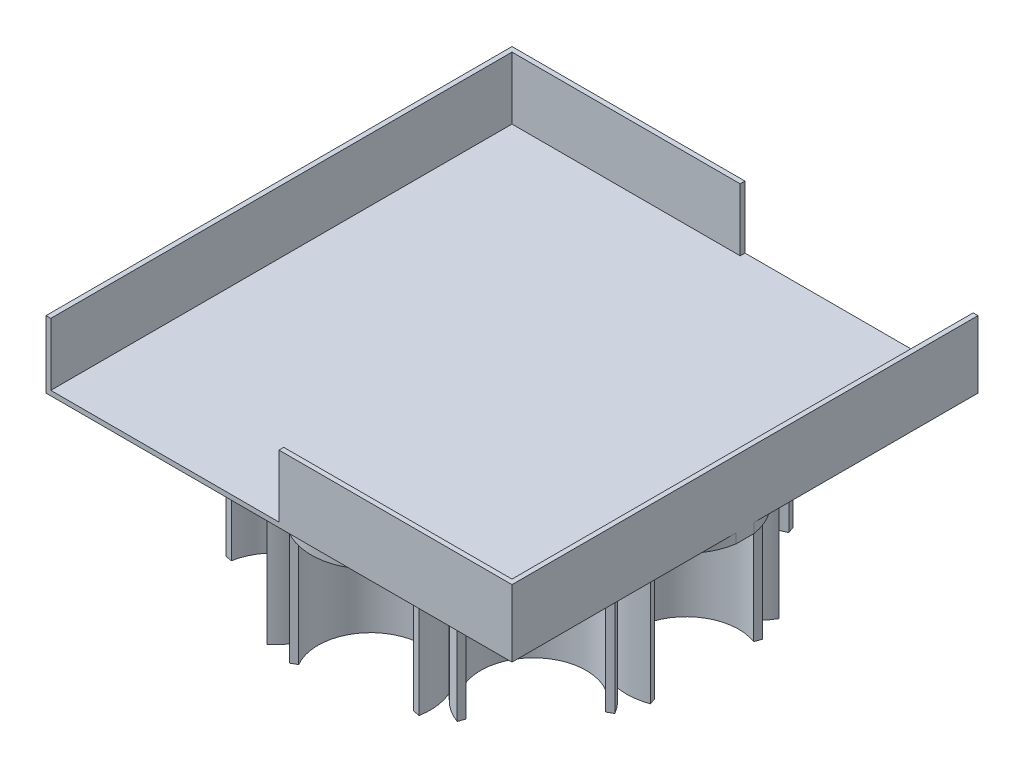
ISO-10303-21;
HEADER;
FILE_DESCRIPTION(('STEP AP214'),'2;1');
FILE_NAME('part.step','',(''),(''),'','','');
FILE_SCHEMA(('AUTOMOTIVE_DESIGN { 1 0 10303 214 1 1 1 1 }'));
ENDSEC;
DATA;
#1=APPLICATION_CONTEXT('core data for automotive mechanical design processes');
#2=APPLICATION_PROTOCOL_DEFINITION('international standard','automotive_design',2000,#1);
#3=PRODUCT_CONTEXT('',#1,'mechanical');
#4=PRODUCT('Part','Part','',(#3));
#5=PRODUCT_RELATED_PRODUCT_CATEGORY('part','',(#4));
#6=PRODUCT_DEFINITION_FORMATION('','',#4);
#7=PRODUCT_DEFINITION_CONTEXT('part definition',#1,'design');
#8=PRODUCT_DEFINITION('design','',#6,#7);
#9=PRODUCT_DEFINITION_SHAPE('','',#8);
#10=(LENGTH_UNIT() NAMED_UNIT(*) SI_UNIT(.MILLI.,.METRE.));
#11=(NAMED_UNIT(*) PLANE_ANGLE_UNIT() SI_UNIT($,.RADIAN.));
#12=(NAMED_UNIT(*) SI_UNIT($,.STERADIAN.) SOLID_ANGLE_UNIT());
#13=UNCERTAINTY_MEASURE_WITH_UNIT(LENGTH_MEASURE(1.E-05),#10,'distance_accuracy_value','');
#14=(GEOMETRIC_REPRESENTATION_CONTEXT(3) GLOBAL_UNCERTAINTY_ASSIGNED_CONTEXT((#13)) GLOBAL_UNIT_ASSIGNED_CONTEXT((#10,
#11,#12)) REPRESENTATION_CONTEXT('',''));
#15=CARTESIAN_POINT('',(0.,0.,0.));
#16=DIRECTION('',(0.,0.,1.));
#17=DIRECTION('',(1.,0.,0.));
#18=AXIS2_PLACEMENT_3D('',#15,#16,#17);
#19=CARTESIAN_POINT('',(0.,0.,0.));
#20=DIRECTION('',(0.,1.,0.));
#21=DIRECTION('',(0.,0.,1.));
#22=AXIS2_PLACEMENT_3D('',#19,#20,#21);
#23=PLANE('',#22);
#24=CARTESIAN_POINT('',(4.12208149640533,0.,-31.915561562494));
#25=DIRECTION('',(0.,-1.,0.));
#26=DIRECTION('',(0.,0.,-1.));
#27=AXIS2_PLACEMENT_3D('',#24,#25,#26);
#28=CIRCLE('',#27,15.76832);
#29=CARTESIAN_POINT('',(-11.4499606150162,0.,-29.4353559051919));
#30=VERTEX_POINT('',#29);
#31=CARTESIAN_POINT('',(17.9067342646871,0.,-24.2589785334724));
#32=VERTEX_POINT('',#31);
#33=EDGE_CURVE('E781',#30,#32,#28,.T.);
#34=ORIENTED_EDGE('',*,*,#33,.F.);
#35=CARTESIAN_POINT('',(-26.9311739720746,0.,-26.4400347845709));
#36=DIRECTION('',(0.,-1.,0.));
#37=DIRECTION('',(0.,0.,-1.));
#38=AXIS2_PLACEMENT_3D('',#35,#36,#37);
#39=CIRCLE('',#38,15.76832);
#40=CARTESIAN_POINT('',(-37.265804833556,0.,-14.5305712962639));
#41=VERTEX_POINT('',#40);
#42=EDGE_CURVE('E741',#41,#30,#39,.T.);
#43=ORIENTED_EDGE('',*,*,#42,.F.);
#44=CARTESIAN_POINT('',(-47.1997469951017,0.,-2.284890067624));
#45=DIRECTION('',(0.,-1.,0.));
#46=DIRECTION('',(0.,0.,-1.));
#47=AXIS2_PLACEMENT_3D('',#44,#45,#46);
#48=CIRCLE('',#47,15.76832);
#49=CARTESIAN_POINT('',(-47.4612779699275,0.,13.4812609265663));
#50=VERTEX_POINT('',#49);
#51=EDGE_CURVE('E1265',#50,#41,#48,.T.);
#52=ORIENTED_EDGE('',*,*,#51,.F.);
#53=CARTESIAN_POINT('',(-47.1997469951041,0.,29.2474119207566));
#54=DIRECTION('',(0.,-1.,0.));
#55=DIRECTION('',(0.,0.,-1.));
#56=AXIS2_PLACEMENT_3D('',#53,#54,#55);
#57=CIRCLE('',#56,15.76832);
#58=CARTESIAN_POINT('',(-37.2658048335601,0.,41.4930931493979));
#59=VERTEX_POINT('',#58);
#60=EDGE_CURVE('E1157',#59,#50,#57,.T.);
#61=ORIENTED_EDGE('',*,*,#60,.F.);
#62=CARTESIAN_POINT('',(-26.9311739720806,0.,53.4025566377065));
#63=DIRECTION('',(0.,-1.,0.));
#64=DIRECTION('',(0.,0.,-1.));
#65=AXIS2_PLACEMENT_3D('',#62,#63,#64);
#66=CIRCLE('',#65,15.76832);
#67=CARTESIAN_POINT('',(-11.449960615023,0.,56.3978777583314));
#68=VERTEX_POINT('',#67);
#69=EDGE_CURVE('E1211',#68,#59,#66,.T.);
#70=ORIENTED_EDGE('',*,*,#69,.F.);
#71=CARTESIAN_POINT('',(4.1220814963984,0.,58.8780834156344));
#72=DIRECTION('',(0.,-1.,0.));
#73=DIRECTION('',(0.,0.,-1.));
#74=AXIS2_PLACEMENT_3D('',#71,#72,#73);
#75=CIRCLE('',#74,15.76832);
#76=CARTESIAN_POINT('',(17.9067342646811,0.,51.2215003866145));
#77=VERTEX_POINT('',#76);
#78=EDGE_CURVE('E2181',#77,#68,#75,.T.);
#79=ORIENTED_EDGE('',*,*,#78,.F.);
#80=CARTESIAN_POINT('',(31.4298560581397,0.,43.1119324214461));
#81=DIRECTION('',(0.,-1.,0.));
#82=DIRECTION('',(0.,0.,-1.));
#83=AXIS2_PLACEMENT_3D('',#80,#81,#82);
#84=CIRCLE('',#83,15.76832);
#85=CARTESIAN_POINT('',(37.0679560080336,0.,28.3860455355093));
#86=VERTEX_POINT('',#85);
#87=EDGE_CURVE('E2124',#86,#77,#84,.T.);
#88=ORIENTED_EDGE('',*,*,#87,.F.);
#89=CARTESIAN_POINT('',(42.214538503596,0.,13.4812609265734));
#90=DIRECTION('',(0.,-1.,0.));
#91=DIRECTION('',(0.,0.,-1.));
#92=AXIS2_PLACEMENT_3D('',#89,#90,#91);
#93=CIRCLE('',#92,15.76832);
#94=CARTESIAN_POINT('',(57.8076468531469,0.,15.8253785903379));
#95=VERTEX_POINT('',#94);
#96=EDGE_CURVE('E986',#95,#86,#93,.T.);
#97=ORIENTED_EDGE('',*,*,#96,.F.);
#98=DIRECTION('',(0.,0.,1.));
#99=VECTOR('',#98,1.);
#100=CARTESIAN_POINT('',(57.8076468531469,0.,0.));
#101=LINE('',#100,#99);
#102=CARTESIAN_POINT('',(57.8076468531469,0.,75.1715109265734));
#103=VERTEX_POINT('',#102);
#104=EDGE_CURVE('E893',#95,#103,#101,.T.);
#105=ORIENTED_EDGE('',*,*,#104,.T.);
#106=DIRECTION('',(1.,0.,0.));
#107=VECTOR('',#106,1.);
#108=CARTESIAN_POINT('',(0.,0.,75.1715109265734));
#109=LINE('',#108,#107);
#110=CARTESIAN_POINT('',(-65.5728531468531,0.,75.1715109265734));
#111=VERTEX_POINT('',#110);
#112=EDGE_CURVE('E898',#111,#103,#109,.T.);
#113=ORIENTED_EDGE('',*,*,#112,.F.);
#114=DIRECTION('',(0.,0.,1.));
#115=VECTOR('',#114,1.);
#116=CARTESIAN_POINT('',(-65.5728531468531,0.,0.));
#117=LINE('',#116,#115);
#118=CARTESIAN_POINT('',(-65.5728531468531,0.,-48.2089890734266));
#119=VERTEX_POINT('',#118);
#120=EDGE_CURVE('E907',#119,#111,#117,.T.);
#121=ORIENTED_EDGE('',*,*,#120,.F.);
#122=DIRECTION('',(1.,0.,0.));
#123=VECTOR('',#122,1.);
#124=CARTESIAN_POINT('',(0.,0.,-48.2089890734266));
#125=LINE('',#124,#123);
#126=CARTESIAN_POINT('',(57.8076468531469,0.,-48.2089890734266));
#127=VERTEX_POINT('',#126);
#128=EDGE_CURVE('E905',#119,#127,#125,.T.);
#129=ORIENTED_EDGE('',*,*,#128,.T.);
#130=CARTESIAN_POINT('',(57.8076468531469,0.,11.1371432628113));
#131=VERTEX_POINT('',#130);
#132=EDGE_CURVE('E902',#127,#131,#101,.T.);
#133=ORIENTED_EDGE('',*,*,#132,.T.);
#134=CARTESIAN_POINT('',(37.0679560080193,0.,-1.4235236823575));
#135=VERTEX_POINT('',#134);
#136=EDGE_CURVE('E1085',#135,#131,#93,.T.);
#137=ORIENTED_EDGE('',*,*,#136,.F.);
#138=CARTESIAN_POINT('',(31.4298560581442,0.,-16.1494105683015));
#139=DIRECTION('',(0.,-1.,0.));
#140=DIRECTION('',(0.,0.,-1.));
#141=AXIS2_PLACEMENT_3D('',#138,#139,#140);
#142=CIRCLE('',#141,15.76832);
#143=EDGE_CURVE('E801',#32,#135,#142,.T.);
#144=ORIENTED_EDGE('',*,*,#143,.F.);
#145=EDGE_LOOP('',(#34,#43,#52,#61,#70,#79,#88,#97,#105,#113,#121,#129,#133,#137,#144));
#146=FACE_BOUND('',#145,.T.);
#147=ADVANCED_FACE('F275',(#146),#23,.F.);
#148=CARTESIAN_POINT('',(-26.9311739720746,0.,-26.4400347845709));
#149=DIRECTION('',(0.,-1.,0.));
#150=DIRECTION('',(0.,0.,-1.));
#151=AXIS2_PLACEMENT_3D('',#148,#149,#150);
#152=CIRCLE('',#151,13.97);
#153=CARTESIAN_POINT('',(-26.9311739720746,0.,-40.4100347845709));
#154=VERTEX_POINT('',#153);
#155=EDGE_CURVE('E731',#154,#154,#152,.T.);
#156=ORIENTED_EDGE('',*,*,#155,.T.);
#157=EDGE_LOOP('',(#156));
#158=FACE_BOUND('',#157,.T.);
#159=ADVANCED_FACE('F1328',(#158),#23,.F.);
#160=CARTESIAN_POINT('',(-47.1997469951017,0.,-2.284890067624));
#161=DIRECTION('',(0.,-1.,0.));
#162=DIRECTION('',(0.,0.,-1.));
#163=AXIS2_PLACEMENT_3D('',#160,#161,#162);
#164=CIRCLE('',#163,13.97);
#165=CARTESIAN_POINT('',(-47.1997469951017,0.,-16.254890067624));
#166=VERTEX_POINT('',#165);
#167=EDGE_CURVE('E1170',#166,#166,#164,.T.);
#168=ORIENTED_EDGE('',*,*,#167,.T.);
#169=EDGE_LOOP('',(#168));
#170=FACE_BOUND('',#169,.T.);
#171=ADVANCED_FACE('F1332',(#170),#23,.F.);
#172=CARTESIAN_POINT('',(-47.1997469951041,0.,29.2474119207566));
#173=DIRECTION('',(0.,-1.,0.));
#174=DIRECTION('',(0.,0.,-1.));
#175=AXIS2_PLACEMENT_3D('',#172,#173,#174);
#176=CIRCLE('',#175,13.97);
#177=CARTESIAN_POINT('',(-47.1997469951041,0.,15.2774119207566));
#178=VERTEX_POINT('',#177);
#179=EDGE_CURVE('E1232',#178,#178,#176,.T.);
#180=ORIENTED_EDGE('',*,*,#179,.T.);
#181=EDGE_LOOP('',(#180));
#182=FACE_BOUND('',#181,.T.);
#183=ADVANCED_FACE('F1819',(#182),#23,.F.);
#184=CARTESIAN_POINT('',(-26.9311739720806,0.,53.4025566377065));
#185=DIRECTION('',(0.,-1.,0.));
#186=DIRECTION('',(0.,0.,-1.));
#187=AXIS2_PLACEMENT_3D('',#184,#185,#186);
#188=CIRCLE('',#187,13.97);
#189=CARTESIAN_POINT('',(-26.9311739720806,0.,39.4325566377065));
#190=VERTEX_POINT('',#189);
#191=EDGE_CURVE('E1214',#190,#190,#188,.T.);
#192=ORIENTED_EDGE('',*,*,#191,.T.);
#193=EDGE_LOOP('',(#192));
#194=FACE_BOUND('',#193,.T.);
#195=ADVANCED_FACE('F1812',(#194),#23,.F.);
#196=CARTESIAN_POINT('',(4.1220814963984,0.,58.8780834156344));
#197=DIRECTION('',(0.,-1.,0.));
#198=DIRECTION('',(0.,0.,-1.));
#199=AXIS2_PLACEMENT_3D('',#196,#197,#198);
#200=CIRCLE('',#199,13.97);
#201=CARTESIAN_POINT('',(4.1220814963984,0.,44.9080834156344));
#202=VERTEX_POINT('',#201);
#203=EDGE_CURVE('E2184',#202,#202,#200,.T.);
#204=ORIENTED_EDGE('',*,*,#203,.T.);
#205=EDGE_LOOP('',(#204));
#206=FACE_BOUND('',#205,.T.);
#207=ADVANCED_FACE('F1805',(#206),#23,.F.);
#208=CARTESIAN_POINT('',(31.4298560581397,0.,43.1119324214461));
#209=DIRECTION('',(0.,-1.,0.));
#210=DIRECTION('',(0.,0.,-1.));
#211=AXIS2_PLACEMENT_3D('',#208,#209,#210);
#212=CIRCLE('',#211,13.97);
#213=CARTESIAN_POINT('',(31.4298560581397,0.,29.1419324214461));
#214=VERTEX_POINT('',#213);
#215=EDGE_CURVE('E2104',#214,#214,#212,.T.);
#216=ORIENTED_EDGE('',*,*,#215,.T.);
#217=EDGE_LOOP('',(#216));
#218=FACE_BOUND('',#217,.T.);
#219=ADVANCED_FACE('F1798',(#218),#23,.F.);
#220=CARTESIAN_POINT('',(42.214538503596,0.,13.4812609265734));
#221=DIRECTION('',(0.,-1.,0.));
#222=DIRECTION('',(0.,0.,-1.));
#223=AXIS2_PLACEMENT_3D('',#220,#221,#222);
#224=CIRCLE('',#223,13.97);
#225=CARTESIAN_POINT('',(42.214538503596,0.,-0.488739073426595));
#226=VERTEX_POINT('',#225);
#227=EDGE_CURVE('E1045',#226,#226,#224,.T.);
#228=ORIENTED_EDGE('',*,*,#227,.T.);
#229=EDGE_LOOP('',(#228));
#230=FACE_BOUND('',#229,.T.);
#231=ADVANCED_FACE('F1791',(#230),#23,.F.);
#232=CARTESIAN_POINT('',(31.4298560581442,0.,-16.1494105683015));
#233=DIRECTION('',(0.,-1.,0.));
#234=DIRECTION('',(0.,0.,-1.));
#235=AXIS2_PLACEMENT_3D('',#232,#233,#234);
#236=CIRCLE('',#235,13.97);
#237=CARTESIAN_POINT('',(31.4298560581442,0.,-30.1194105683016));
#238=VERTEX_POINT('',#237);
#239=EDGE_CURVE('E815',#238,#238,#236,.T.);
#240=ORIENTED_EDGE('',*,*,#239,.T.);
#241=EDGE_LOOP('',(#240));
#242=FACE_BOUND('',#241,.T.);
#243=ADVANCED_FACE('F1785',(#242),#23,.F.);
#244=CARTESIAN_POINT('',(-46.9382160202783,0.,13.4812609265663));
#245=VERTEX_POINT('',#244);
#246=CARTESIAN_POINT('',(-36.8651161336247,0.,41.1568754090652));
#247=VERTEX_POINT('',#246);
#248=EDGE_CURVE('E1242',#245,#247,#57,.T.);
#249=ORIENTED_EDGE('',*,*,#248,.F.);
#250=CARTESIAN_POINT('',(-36.8651161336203,0.,-14.194353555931));
#251=VERTEX_POINT('',#250);
#252=EDGE_CURVE('E1153',#251,#245,#48,.T.);
#253=ORIENTED_EDGE('',*,*,#252,.F.);
#254=CARTESIAN_POINT('',(-11.359131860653,0.,-28.920240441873));
#255=VERTEX_POINT('',#254);
#256=EDGE_CURVE('E734',#255,#251,#39,.T.);
#257=ORIENTED_EDGE('',*,*,#256,.F.);
#258=CARTESIAN_POINT('',(17.6452032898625,0.,-23.8059935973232));
#259=VERTEX_POINT('',#258);
#260=EDGE_CURVE('E775',#259,#255,#28,.T.);
#261=ORIENTED_EDGE('',*,*,#260,.F.);
#262=CARTESIAN_POINT('',(36.5764385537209,0.,-1.24462595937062));
#263=VERTEX_POINT('',#262);
#264=EDGE_CURVE('E1070',#263,#259,#142,.T.);
#265=ORIENTED_EDGE('',*,*,#264,.F.);
#266=CARTESIAN_POINT('',(36.5764385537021,0.,28.2071478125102));
#267=VERTEX_POINT('',#266);
#268=EDGE_CURVE('E1082',#267,#263,#93,.T.);
#269=ORIENTED_EDGE('',*,*,#268,.F.);
#270=CARTESIAN_POINT('',(17.645203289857,0.,50.768515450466));
#271=VERTEX_POINT('',#270);
#272=EDGE_CURVE('E2127',#271,#267,#84,.T.);
#273=ORIENTED_EDGE('',*,*,#272,.F.);
#274=CARTESIAN_POINT('',(-11.3591318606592,0.,55.8827622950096));
#275=VERTEX_POINT('',#274);
#276=EDGE_CURVE('E2183',#275,#271,#75,.T.);
#277=ORIENTED_EDGE('',*,*,#276,.F.);
#278=EDGE_CURVE('E1209',#247,#275,#66,.T.);
#279=ORIENTED_EDGE('',*,*,#278,.F.);
#280=EDGE_LOOP('',(#249,#253,#257,#261,#265,#269,#273,#277,#279));
#281=FACE_BOUND('',#280,.T.);
#282=CARTESIAN_POINT('',(-3.88260314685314,0.,13.4812609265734));
#283=DIRECTION('',(0.,1.,0.));
#284=DIRECTION('',(0.,0.,1.));
#285=AXIS2_PLACEMENT_3D('',#282,#283,#284);
#286=CIRCLE('',#285,15.76832);
#287=CARTESIAN_POINT('',(-3.88260314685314,0.,29.2495809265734));
#288=VERTEX_POINT('',#287);
#289=EDGE_CURVE('E12',#288,#288,#286,.F.);
#290=ORIENTED_EDGE('',*,*,#289,.F.);
#291=EDGE_LOOP('',(#290));
#292=FACE_BOUND('',#291,.T.);
#293=ADVANCED_FACE('F1757',(#281,#292),#23,.F.);
#294=CARTESIAN_POINT('',(-3.88260314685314,-38.1,13.4812609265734));
#295=DIRECTION('',(0.,1.,0.));
#296=DIRECTION('',(0.,0.,1.));
#297=AXIS2_PLACEMENT_3D('',#294,#295,#296);
#298=CYLINDRICAL_SURFACE('',#297,13.97);
#299=CARTESIAN_POINT('',(-3.88260314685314,-38.1,13.4812609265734));
#300=DIRECTION('',(0.,-1.,0.));
#301=DIRECTION('',(0.,0.,-1.));
#302=AXIS2_PLACEMENT_3D('',#299,#300,#301);
#303=CIRCLE('',#302,13.97);
#304=CARTESIAN_POINT('',(-3.88260314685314,-38.1,27.4512609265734));
#305=VERTEX_POINT('',#304);
#306=EDGE_CURVE('E828',#305,#305,#303,.T.);
#307=CARTESIAN_POINT('',(-3.88260314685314,0.,13.4812609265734));
#308=DIRECTION('',(0.,-1.,0.));
#309=DIRECTION('',(0.,0.,-1.));
#310=AXIS2_PLACEMENT_3D('',#307,#308,#309);
#311=CIRCLE('',#310,13.97);
#312=CARTESIAN_POINT('',(-3.88260314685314,0.,27.4512609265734));
#313=VERTEX_POINT('',#312);
#314=EDGE_CURVE('E832',#313,#313,#311,.T.);
#315=CARTESIAN_POINT('',(-3.88260314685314,-38.1,27.4512609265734));
#316=CARTESIAN_POINT('',(-3.88260314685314,-37.703125,27.4512609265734));
#317=CARTESIAN_POINT('',(-3.88260314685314,-37.30625,27.4512609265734));
#318=CARTESIAN_POINT('',(-3.88260314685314,-36.5125,27.4512609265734));
#319=CARTESIAN_POINT('',(-3.88260314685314,-36.115625,27.4512609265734));
#320=CARTESIAN_POINT('',(-3.88260314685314,-35.321875,27.4512609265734));
#321=CARTESIAN_POINT('',(-3.88260314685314,-34.925,27.4512609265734));
#322=CARTESIAN_POINT('',(-3.88260314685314,-34.13125,27.4512609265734));
#323=CARTESIAN_POINT('',(-3.88260314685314,-33.734375,27.4512609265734));
#324=CARTESIAN_POINT('',(-3.88260314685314,-32.940625,27.4512609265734));
#325=CARTESIAN_POINT('',(-3.88260314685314,-32.54375,27.4512609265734));
#326=CARTESIAN_POINT('',(-3.88260314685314,-31.75,27.4512609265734));
#327=CARTESIAN_POINT('',(-3.88260314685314,-31.353125,27.4512609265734));
#328=CARTESIAN_POINT('',(-3.88260314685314,-30.559375,27.4512609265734));
#329=CARTESIAN_POINT('',(-3.88260314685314,-30.1625,27.4512609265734));
#330=CARTESIAN_POINT('',(-3.88260314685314,-29.36875,27.4512609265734));
#331=CARTESIAN_POINT('',(-3.88260314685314,-28.971875,27.4512609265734));
#332=CARTESIAN_POINT('',(-3.88260314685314,-28.178125,27.4512609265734));
#333=CARTESIAN_POINT('',(-3.88260314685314,-27.78125,27.4512609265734));
#334=CARTESIAN_POINT('',(-3.88260314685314,-26.9875,27.4512609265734));
#335=CARTESIAN_POINT('',(-3.88260314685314,-26.590625,27.4512609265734));
#336=CARTESIAN_POINT('',(-3.88260314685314,-25.796875,27.4512609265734));
#337=CARTESIAN_POINT('',(-3.88260314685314,-25.4,27.4512609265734));
#338=CARTESIAN_POINT('',(-3.88260314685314,-24.60625,27.4512609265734));
#339=CARTESIAN_POINT('',(-3.88260314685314,-24.209375,27.4512609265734));
#340=CARTESIAN_POINT('',(-3.88260314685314,-23.415625,27.4512609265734));
#341=CARTESIAN_POINT('',(-3.88260314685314,-23.01875,27.4512609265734));
#342=CARTESIAN_POINT('',(-3.88260314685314,-22.225,27.4512609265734));
#343=CARTESIAN_POINT('',(-3.88260314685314,-21.828125,27.4512609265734));
#344=CARTESIAN_POINT('',(-3.88260314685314,-21.034375,27.4512609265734));
#345=CARTESIAN_POINT('',(-3.88260314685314,-20.6375,27.4512609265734));
#346=CARTESIAN_POINT('',(-3.88260314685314,-19.84375,27.4512609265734));
#347=CARTESIAN_POINT('',(-3.88260314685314,-19.446875,27.4512609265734));
#348=CARTESIAN_POINT('',(-3.88260314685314,-18.653125,27.4512609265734));
#349=CARTESIAN_POINT('',(-3.88260314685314,-18.25625,27.4512609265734));
#350=CARTESIAN_POINT('',(-3.88260314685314,-17.4625,27.4512609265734));
#351=CARTESIAN_POINT('',(-3.88260314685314,-17.065625,27.4512609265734));
#352=CARTESIAN_POINT('',(-3.88260314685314,-16.271875,27.4512609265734));
#353=CARTESIAN_POINT('',(-3.88260314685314,-15.875,27.4512609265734));
#354=CARTESIAN_POINT('',(-3.88260314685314,-15.08125,27.4512609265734));
#355=CARTESIAN_POINT('',(-3.88260314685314,-14.684375,27.4512609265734));
#356=CARTESIAN_POINT('',(-3.88260314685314,-13.890625,27.4512609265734));
#357=CARTESIAN_POINT('',(-3.88260314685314,-13.49375,27.4512609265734));
#358=CARTESIAN_POINT('',(-3.88260314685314,-12.7,27.4512609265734));
#359=CARTESIAN_POINT('',(-3.88260314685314,-12.303125,27.4512609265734));
#360=CARTESIAN_POINT('',(-3.88260314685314,-11.509375,27.4512609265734));
#361=CARTESIAN_POINT('',(-3.88260314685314,-11.1125,27.4512609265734));
#362=CARTESIAN_POINT('',(-3.88260314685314,-10.31875,27.4512609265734));
#363=CARTESIAN_POINT('',(-3.88260314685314,-9.921875,27.4512609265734));
#364=CARTESIAN_POINT('',(-3.88260314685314,-9.128125,27.4512609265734));
#365=CARTESIAN_POINT('',(-3.88260314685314,-8.73125,27.4512609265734));
#366=CARTESIAN_POINT('',(-3.88260314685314,-7.9375,27.4512609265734));
#367=CARTESIAN_POINT('',(-3.88260314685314,-7.540625,27.4512609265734));
#368=CARTESIAN_POINT('',(-3.88260314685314,-6.746875,27.4512609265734));
#369=CARTESIAN_POINT('',(-3.88260314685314,-6.35,27.4512609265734));
#370=CARTESIAN_POINT('',(-3.88260314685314,-5.55625,27.4512609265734));
#371=CARTESIAN_POINT('',(-3.88260314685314,-5.159375,27.4512609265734));
#372=CARTESIAN_POINT('',(-3.88260314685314,-4.365625,27.4512609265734));
#373=CARTESIAN_POINT('',(-3.88260314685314,-3.96875,27.4512609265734));
#374=CARTESIAN_POINT('',(-3.88260314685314,-3.175,27.4512609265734));
#375=CARTESIAN_POINT('',(-3.88260314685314,-2.778125,27.4512609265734));
#376=CARTESIAN_POINT('',(-3.88260314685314,-1.984375,27.4512609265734));
#377=CARTESIAN_POINT('',(-3.88260314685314,-1.5875,27.4512609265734));
#378=CARTESIAN_POINT('',(-3.88260314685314,-0.79375,27.4512609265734));
#379=CARTESIAN_POINT('',(-3.88260314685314,-0.396875,27.4512609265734));
#380=CARTESIAN_POINT('',(-3.88260314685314,0.,27.4512609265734));
#381=B_SPLINE_CURVE_WITH_KNOTS('',3,(#315,#316,#317,#318,#319,#320,#321,#322,#323,#324,#325,
#326,#327,#328,#329,#330,#331,#332,#333,#334,#335,#336,#337,#338,#339,#340,#341,#342,#343,#344,
#345,#346,#347,#348,#349,#350,#351,#352,#353,#354,#355,#356,#357,#358,#359,#360,#361,#362,#363,
#364,#365,#366,#367,#368,#369,#370,#371,#372,#373,#374,#375,#376,#377,#378,#379,#380),
.UNSPECIFIED.,.F.,.F.,(4,2,2,2,2,2,2,2,2,2,2,2,2,2,2,2,2,2,2,2,2,2,2,2,2,2,2,2,2,2,2,2,4),(0.,
1.19062499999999,2.38124999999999,3.571875,4.7625,5.953125,7.14375,8.33437499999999,9.525,
10.715625,11.90625,13.096875,14.2875,15.478125,16.66875,17.859375,19.05,20.240625,21.43125,
22.621875,23.8125,25.003125,26.19375,27.384375,28.575,29.765625,30.95625,32.146875,33.3375,
34.528125,35.71875,36.909375,38.1),.UNSPECIFIED.);
#382=EDGE_CURVE('BSEAM1771',#305,#313,#381,.T.);
#383=ORIENTED_EDGE('',*,*,#306,.T.);
#384=ORIENTED_EDGE('',*,*,#314,.F.);
#385=ORIENTED_EDGE('',*,*,#382,.T.);
#386=ORIENTED_EDGE('',*,*,#382,.F.);
#387=EDGE_LOOP('',(#383,#385,#384,#386));
#388=FACE_BOUND('',#387,.T.);
#389=ADVANCED_FACE('F1771',(#388),#298,.F.);
#390=CARTESIAN_POINT('',(-3.88260314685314,-38.1,13.4812609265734));
#391=DIRECTION('',(0.,1.,0.));
#392=DIRECTION('',(0.,0.,1.));
#393=AXIS2_PLACEMENT_3D('',#390,#391,#392);
#394=CYLINDRICAL_SURFACE('',#393,15.76832);
#395=CARTESIAN_POINT('',(-3.88260314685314,-38.1,13.4812609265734));
#396=DIRECTION('',(0.,-1.,0.));
#397=DIRECTION('',(0.,0.,-1.));
#398=AXIS2_PLACEMENT_3D('',#395,#396,#397);
#399=CIRCLE('',#398,15.76832);
#400=CARTESIAN_POINT('',(-3.88260314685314,-38.1,29.2495809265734));
#401=VERTEX_POINT('',#400);
#402=EDGE_CURVE('E831',#401,#401,#399,.T.);
#403=CARTESIAN_POINT('',(-3.88260314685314,-38.1,29.2495809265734));
#404=CARTESIAN_POINT('',(-3.88260314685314,-37.703125,29.2495809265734));
#405=CARTESIAN_POINT('',(-3.88260314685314,-37.30625,29.2495809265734));
#406=CARTESIAN_POINT('',(-3.88260314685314,-36.5125,29.2495809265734));
#407=CARTESIAN_POINT('',(-3.88260314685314,-36.115625,29.2495809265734));
#408=CARTESIAN_POINT('',(-3.88260314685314,-35.321875,29.2495809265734));
#409=CARTESIAN_POINT('',(-3.88260314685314,-34.925,29.2495809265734));
#410=CARTESIAN_POINT('',(-3.88260314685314,-34.13125,29.2495809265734));
#411=CARTESIAN_POINT('',(-3.88260314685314,-33.734375,29.2495809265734));
#412=CARTESIAN_POINT('',(-3.88260314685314,-32.940625,29.2495809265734));
#413=CARTESIAN_POINT('',(-3.88260314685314,-32.54375,29.2495809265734));
#414=CARTESIAN_POINT('',(-3.88260314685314,-31.75,29.2495809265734));
#415=CARTESIAN_POINT('',(-3.88260314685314,-31.353125,29.2495809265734));
#416=CARTESIAN_POINT('',(-3.88260314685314,-30.559375,29.2495809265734));
#417=CARTESIAN_POINT('',(-3.88260314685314,-30.1625,29.2495809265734));
#418=CARTESIAN_POINT('',(-3.88260314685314,-29.36875,29.2495809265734));
#419=CARTESIAN_POINT('',(-3.88260314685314,-28.971875,29.2495809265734));
#420=CARTESIAN_POINT('',(-3.88260314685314,-28.178125,29.2495809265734));
#421=CARTESIAN_POINT('',(-3.88260314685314,-27.78125,29.2495809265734));
#422=CARTESIAN_POINT('',(-3.88260314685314,-26.9875,29.2495809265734));
#423=CARTESIAN_POINT('',(-3.88260314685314,-26.590625,29.2495809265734));
#424=CARTESIAN_POINT('',(-3.88260314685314,-25.796875,29.2495809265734));
#425=CARTESIAN_POINT('',(-3.88260314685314,-25.4,29.2495809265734));
#426=CARTESIAN_POINT('',(-3.88260314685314,-24.60625,29.2495809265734));
#427=CARTESIAN_POINT('',(-3.88260314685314,-24.209375,29.2495809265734));
#428=CARTESIAN_POINT('',(-3.88260314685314,-23.415625,29.2495809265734));
#429=CARTESIAN_POINT('',(-3.88260314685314,-23.01875,29.2495809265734));
#430=CARTESIAN_POINT('',(-3.88260314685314,-22.225,29.2495809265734));
#431=CARTESIAN_POINT('',(-3.88260314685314,-21.828125,29.2495809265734));
#432=CARTESIAN_POINT('',(-3.88260314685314,-21.034375,29.2495809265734));
#433=CARTESIAN_POINT('',(-3.88260314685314,-20.6375,29.2495809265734));
#434=CARTESIAN_POINT('',(-3.88260314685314,-19.84375,29.2495809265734));
#435=CARTESIAN_POINT('',(-3.88260314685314,-19.446875,29.2495809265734));
#436=CARTESIAN_POINT('',(-3.88260314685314,-18.653125,29.2495809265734));
#437=CARTESIAN_POINT('',(-3.88260314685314,-18.25625,29.2495809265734));
#438=CARTESIAN_POINT('',(-3.88260314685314,-17.4625,29.2495809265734));
#439=CARTESIAN_POINT('',(-3.88260314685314,-17.065625,29.2495809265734));
#440=CARTESIAN_POINT('',(-3.88260314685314,-16.271875,29.2495809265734));
#441=CARTESIAN_POINT('',(-3.88260314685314,-15.875,29.2495809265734));
#442=CARTESIAN_POINT('',(-3.88260314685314,-15.08125,29.2495809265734));
#443=CARTESIAN_POINT('',(-3.88260314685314,-14.684375,29.2495809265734));
#444=CARTESIAN_POINT('',(-3.88260314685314,-13.890625,29.2495809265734));
#445=CARTESIAN_POINT('',(-3.88260314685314,-13.49375,29.2495809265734));
#446=CARTESIAN_POINT('',(-3.88260314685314,-12.7,29.2495809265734));
#447=CARTESIAN_POINT('',(-3.88260314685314,-12.303125,29.2495809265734));
#448=CARTESIAN_POINT('',(-3.88260314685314,-11.509375,29.2495809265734));
#449=CARTESIAN_POINT('',(-3.88260314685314,-11.1125,29.2495809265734));
#450=CARTESIAN_POINT('',(-3.88260314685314,-10.31875,29.2495809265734));
#451=CARTESIAN_POINT('',(-3.88260314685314,-9.921875,29.2495809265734));
#452=CARTESIAN_POINT('',(-3.88260314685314,-9.128125,29.2495809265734));
#453=CARTESIAN_POINT('',(-3.88260314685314,-8.73125,29.2495809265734));
#454=CARTESIAN_POINT('',(-3.88260314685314,-7.9375,29.2495809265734));
#455=CARTESIAN_POINT('',(-3.88260314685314,-7.540625,29.2495809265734));
#456=CARTESIAN_POINT('',(-3.88260314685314,-6.746875,29.2495809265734));
#457=CARTESIAN_POINT('',(-3.88260314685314,-6.35,29.2495809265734));
#458=CARTESIAN_POINT('',(-3.88260314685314,-5.55625,29.2495809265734));
#459=CARTESIAN_POINT('',(-3.88260314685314,-5.159375,29.2495809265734));
#460=CARTESIAN_POINT('',(-3.88260314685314,-4.365625,29.2495809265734));
#461=CARTESIAN_POINT('',(-3.88260314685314,-3.96875,29.2495809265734));
#462=CARTESIAN_POINT('',(-3.88260314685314,-3.175,29.2495809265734));
#463=CARTESIAN_POINT('',(-3.88260314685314,-2.778125,29.2495809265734));
#464=CARTESIAN_POINT('',(-3.88260314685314,-1.984375,29.2495809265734));
#465=CARTESIAN_POINT('',(-3.88260314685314,-1.5875,29.2495809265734));
#466=CARTESIAN_POINT('',(-3.88260314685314,-0.79375,29.2495809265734));
#467=CARTESIAN_POINT('',(-3.88260314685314,-0.396875,29.2495809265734));
#468=CARTESIAN_POINT('',(-3.88260314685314,0.,29.2495809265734));
#469=B_SPLINE_CURVE_WITH_KNOTS('',3,(#403,#404,#405,#406,#407,#408,#409,#410,#411,#412,#413,
#414,#415,#416,#417,#418,#419,#420,#421,#422,#423,#424,#425,#426,#427,#428,#429,#430,#431,#432,
#433,#434,#435,#436,#437,#438,#439,#440,#441,#442,#443,#444,#445,#446,#447,#448,#449,#450,#451,
#452,#453,#454,#455,#456,#457,#458,#459,#460,#461,#462,#463,#464,#465,#466,#467,#468),
.UNSPECIFIED.,.F.,.F.,(4,2,2,2,2,2,2,2,2,2,2,2,2,2,2,2,2,2,2,2,2,2,2,2,2,2,2,2,2,2,2,2,4),(0.,
1.19062499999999,2.38124999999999,3.571875,4.7625,5.953125,7.14375,8.33437499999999,9.525,
10.715625,11.90625,13.096875,14.2875,15.478125,16.66875,17.859375,19.05,20.240625,21.43125,
22.621875,23.8125,25.003125,26.19375,27.384375,28.575,29.765625,30.95625,32.146875,33.3375,
34.528125,35.71875,36.909375,38.1),.UNSPECIFIED.);
#470=EDGE_CURVE('BSEAM1763',#401,#288,#469,.T.);
#471=ORIENTED_EDGE('',*,*,#402,.F.);
#472=ORIENTED_EDGE('',*,*,#289,.T.);
#473=ORIENTED_EDGE('',*,*,#470,.T.);
#474=ORIENTED_EDGE('',*,*,#470,.F.);
#475=EDGE_LOOP('',(#471,#473,#472,#474));
#476=FACE_BOUND('',#475,.T.);
#477=ADVANCED_FACE('F1763',(#476),#394,.T.);
#478=CARTESIAN_POINT('',(0.,-38.1,0.));
#479=DIRECTION('',(0.,-1.,0.));
#480=DIRECTION('',(0.,0.,-1.));
#481=AXIS2_PLACEMENT_3D('',#478,#479,#480);
#482=PLANE('',#481);
#483=ORIENTED_EDGE('',*,*,#306,.F.);
#484=EDGE_LOOP('',(#483));
#485=FACE_BOUND('',#484,.T.);
#486=ORIENTED_EDGE('',*,*,#402,.T.);
#487=EDGE_LOOP('',(#486));
#488=FACE_BOUND('',#487,.T.);
#489=ADVANCED_FACE('F1755',(#485,#488),#482,.T.);
#490=ORIENTED_EDGE('',*,*,#314,.T.);
#491=EDGE_LOOP('',(#490));
#492=FACE_BOUND('',#491,.T.);
#493=ADVANCED_FACE('F1325',(#492),#23,.F.);
#494=CARTESIAN_POINT('',(-47.1997469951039,-38.1,43.2174119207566));
#495=DIRECTION('',(-1.,0.,0.));
#496=DIRECTION('',(0.,0.,1.));
#497=AXIS2_PLACEMENT_3D('',#494,#495,#496);
#498=PLANE('',#497);
#499=DIRECTION('',(0.,0.,1.));
#500=VECTOR('',#499,1.);
#501=CARTESIAN_POINT('',(-47.1997469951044,-2.54,5.46366670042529E-13));
#502=LINE('',#501,#500);
#503=CARTESIAN_POINT('',(-47.1997469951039,-2.54,43.2174119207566));
#504=VERTEX_POINT('',#503);
#505=CARTESIAN_POINT('',(-47.1997469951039,-2.54,45.0157319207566));
#506=VERTEX_POINT('',#505);
#507=EDGE_CURVE('E2043',#504,#506,#502,.T.);
#508=ORIENTED_EDGE('',*,*,#507,.F.);
#509=DIRECTION('',(0.,1.,0.));
#510=VECTOR('',#509,1.);
#511=CARTESIAN_POINT('',(-47.1997469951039,-38.1,43.2174119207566));
#512=LINE('',#511,#510);
#513=CARTESIAN_POINT('',(-47.1997469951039,-38.1,43.2174119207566));
#514=VERTEX_POINT('',#513);
#515=EDGE_CURVE('E1245',#514,#504,#512,.T.);
#516=ORIENTED_EDGE('',*,*,#515,.F.);
#517=DIRECTION('',(0.,0.,1.));
#518=VECTOR('',#517,1.);
#519=CARTESIAN_POINT('',(-47.1997469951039,-38.1,43.2174119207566));
#520=LINE('',#519,#518);
#521=CARTESIAN_POINT('',(-47.1997469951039,-38.1,45.0157319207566));
#522=VERTEX_POINT('',#521);
#523=EDGE_CURVE('E1233',#514,#522,#520,.T.);
#524=ORIENTED_EDGE('',*,*,#523,.T.);
#525=DIRECTION('',(0.,1.,0.));
#526=VECTOR('',#525,1.);
#527=CARTESIAN_POINT('',(-47.1997469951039,-38.1,45.0157319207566));
#528=LINE('',#527,#526);
#529=EDGE_CURVE('E1248',#522,#506,#528,.T.);
#530=ORIENTED_EDGE('',*,*,#529,.T.);
#531=EDGE_LOOP('',(#508,#516,#524,#530));
#532=FACE_BOUND('',#531,.T.);
#533=ADVANCED_FACE('F1418',(#532),#498,.T.);
#534=CARTESIAN_POINT('',(-47.1997469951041,-38.1,29.2474119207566));
#535=DIRECTION('',(0.,1.,0.));
#536=DIRECTION('',(0.,0.,1.));
#537=AXIS2_PLACEMENT_3D('',#534,#535,#536);
#538=CYLINDRICAL_SURFACE('',#537,13.97);
#539=ORIENTED_EDGE('',*,*,#179,.F.);
#540=EDGE_LOOP('',(#539));
#541=FACE_BOUND('',#540,.T.);
#542=ORIENTED_EDGE('',*,*,#515,.T.);
#543=CARTESIAN_POINT('',(-47.1997469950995,-2.54,29.2474119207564));
#544=DIRECTION('',(0.,-1.,0.));
#545=DIRECTION('',(0.,0.,-1.));
#546=AXIS2_PLACEMENT_3D('',#543,#544,#545);
#547=CIRCLE('',#546,13.97);
#548=CARTESIAN_POINT('',(-56.1794899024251,-2.54,18.5457710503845));
#549=VERTEX_POINT('',#548);
#550=EDGE_CURVE('E2038',#504,#549,#547,.T.);
#551=ORIENTED_EDGE('',*,*,#550,.T.);
#552=DIRECTION('',(0.,1.,0.));
#553=VECTOR('',#552,1.);
#554=CARTESIAN_POINT('',(-56.1794899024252,-38.1,18.5457710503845));
#555=LINE('',#554,#553);
#556=CARTESIAN_POINT('',(-56.1794899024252,-38.1,18.5457710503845));
#557=VERTEX_POINT('',#556);
#558=EDGE_CURVE('E1239',#557,#549,#555,.T.);
#559=ORIENTED_EDGE('',*,*,#558,.F.);
#560=CARTESIAN_POINT('',(-47.1997469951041,-38.1,29.2474119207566));
#561=DIRECTION('',(0.,-1.,0.));
#562=DIRECTION('',(0.,0.,-1.));
#563=AXIS2_PLACEMENT_3D('',#560,#561,#562);
#564=CIRCLE('',#563,13.97);
#565=EDGE_CURVE('E1236',#557,#514,#564,.T.);
#566=ORIENTED_EDGE('',*,*,#565,.T.);
#567=EDGE_LOOP('',(#542,#551,#559,#566));
#568=FACE_BOUND('',#567,.T.);
#569=ADVANCED_FACE('F1733',(#541,#568),#538,.F.);
#570=CARTESIAN_POINT('',(-56.1794899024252,-38.1,18.5457710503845));
#571=DIRECTION('',(0.766044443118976,0.,-0.642787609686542));
#572=DIRECTION('',(-0.642787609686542,0.,-0.766044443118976));
#573=AXIS2_PLACEMENT_3D('',#570,#571,#572);
#574=PLANE('',#573);
#575=ORIENTED_EDGE('',*,*,#558,.T.);
#576=DIRECTION('',(0.642787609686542,0.,0.766044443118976));
#577=VECTOR('',#576,1.);
#578=CARTESIAN_POINT('',(-42.0994875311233,-2.54,35.3256644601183));
#579=LINE('',#578,#577);
#580=CARTESIAN_POINT('',(-57.3354277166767,-2.54,17.1681780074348));
#581=VERTEX_POINT('',#580);
#582=EDGE_CURVE('E2047',#581,#549,#579,.T.);
#583=ORIENTED_EDGE('',*,*,#582,.F.);
#584=DIRECTION('',(0.,1.,0.));
#585=VECTOR('',#584,1.);
#586=CARTESIAN_POINT('',(-57.3354277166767,-38.1,17.1681780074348));
#587=LINE('',#586,#585);
#588=CARTESIAN_POINT('',(-57.3354277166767,-38.1,17.1681780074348));
#589=VERTEX_POINT('',#588);
#590=EDGE_CURVE('E1251',#589,#581,#587,.T.);
#591=ORIENTED_EDGE('',*,*,#590,.F.);
#592=DIRECTION('',(-0.642787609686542,0.,-0.766044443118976));
#593=VECTOR('',#592,1.);
#594=CARTESIAN_POINT('',(-56.1794899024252,-38.1,18.5457710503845));
#595=LINE('',#594,#593);
#596=EDGE_CURVE('E1198',#557,#589,#595,.T.);
#597=ORIENTED_EDGE('',*,*,#596,.F.);
#598=EDGE_LOOP('',(#575,#583,#591,#597));
#599=FACE_BOUND('',#598,.T.);
#600=ADVANCED_FACE('F1726',(#599),#574,.F.);
#601=CARTESIAN_POINT('',(-47.1997469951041,-38.1,29.2474119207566));
#602=DIRECTION('',(0.,1.,0.));
#603=DIRECTION('',(0.,0.,1.));
#604=AXIS2_PLACEMENT_3D('',#601,#602,#603);
#605=CYLINDRICAL_SURFACE('',#604,15.76832);
#606=CARTESIAN_POINT('',(-47.1997469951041,-38.1,29.2474119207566));
#607=DIRECTION('',(0.,-1.,0.));
#608=DIRECTION('',(0.,0.,-1.));
#609=AXIS2_PLACEMENT_3D('',#606,#607,#608);
#610=CIRCLE('',#609,15.76832);
#611=CARTESIAN_POINT('',(-37.2658048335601,-38.1,41.4930931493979));
#612=VERTEX_POINT('',#611);
#613=EDGE_CURVE('E1186',#612,#522,#610,.T.);
#614=ORIENTED_EDGE('',*,*,#613,.F.);
#615=DIRECTION('',(0.,1.,0.));
#616=VECTOR('',#615,1.);
#617=CARTESIAN_POINT('',(-37.2658048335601,-19.05,41.4930931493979));
#618=LINE('',#617,#616);
#619=EDGE_CURVE('E1208',#612,#59,#618,.T.);
#620=ORIENTED_EDGE('',*,*,#619,.T.);
#621=ORIENTED_EDGE('',*,*,#60,.T.);
#622=DIRECTION('',(0.,1.,0.));
#623=VECTOR('',#622,1.);
#624=CARTESIAN_POINT('',(-47.4612779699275,-19.05,13.4812609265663));
#625=LINE('',#624,#623);
#626=CARTESIAN_POINT('',(-47.4612779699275,-38.1,13.4812609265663));
#627=VERTEX_POINT('',#626);
#628=EDGE_CURVE('E1255',#627,#50,#625,.T.);
#629=ORIENTED_EDGE('',*,*,#628,.F.);
#630=EDGE_CURVE('E1187',#589,#627,#610,.T.);
#631=ORIENTED_EDGE('',*,*,#630,.F.);
#632=ORIENTED_EDGE('',*,*,#590,.T.);
#633=CARTESIAN_POINT('',(-47.1997469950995,-2.54,29.2474119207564));
#634=DIRECTION('',(0.,-1.,0.));
#635=DIRECTION('',(0.,0.,-1.));
#636=AXIS2_PLACEMENT_3D('',#633,#634,#635);
#637=CIRCLE('',#636,15.76832);
#638=EDGE_CURVE('E2045',#506,#581,#637,.T.);
#639=ORIENTED_EDGE('',*,*,#638,.F.);
#640=ORIENTED_EDGE('',*,*,#529,.F.);
#641=EDGE_LOOP('',(#614,#620,#621,#629,#631,#632,#639,#640));
#642=FACE_BOUND('',#641,.T.);
#643=ADVANCED_FACE('F1692',(#642),#605,.T.);
#644=CARTESIAN_POINT('',(-17.9514310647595,-38.1,64.1041975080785));
#645=DIRECTION('',(-0.766044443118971,0.,0.642787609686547));
#646=DIRECTION('',(0.642787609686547,0.,0.766044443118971));
#647=AXIS2_PLACEMENT_3D('',#644,#645,#646);
#648=PLANE('',#647);
#649=DIRECTION('',(0.642787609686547,0.,0.766044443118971));
#650=VECTOR('',#649,1.);
#651=CARTESIAN_POINT('',(-42.099487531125,-2.54,35.3256644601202));
#652=LINE('',#651,#650);
#653=CARTESIAN_POINT('',(-17.9514310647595,-2.54000000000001,64.1041975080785));
#654=VERTEX_POINT('',#653);
#655=CARTESIAN_POINT('',(-16.795493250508,-2.54000000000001,65.4817905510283));
#656=VERTEX_POINT('',#655);
#657=EDGE_CURVE('E290',#654,#656,#652,.T.);
#658=ORIENTED_EDGE('',*,*,#657,.F.);
#659=DIRECTION('',(0.,1.,0.));
#660=VECTOR('',#659,1.);
#661=CARTESIAN_POINT('',(-17.9514310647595,-38.1,64.1041975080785));
#662=LINE('',#661,#660);
#663=CARTESIAN_POINT('',(-17.9514310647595,-38.1,64.1041975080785));
#664=VERTEX_POINT('',#663);
#665=EDGE_CURVE('E2161',#664,#654,#662,.T.);
#666=ORIENTED_EDGE('',*,*,#665,.F.);
#667=DIRECTION('',(0.642787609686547,0.,0.766044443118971));
#668=VECTOR('',#667,1.);
#669=CARTESIAN_POINT('',(-17.9514310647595,-38.1,64.1041975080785));
#670=LINE('',#669,#668);
#671=CARTESIAN_POINT('',(-16.795493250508,-38.1,65.4817905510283));
#672=VERTEX_POINT('',#671);
#673=EDGE_CURVE('E2152',#664,#672,#670,.T.);
#674=ORIENTED_EDGE('',*,*,#673,.T.);
#675=DIRECTION('',(0.,1.,0.));
#676=VECTOR('',#675,1.);
#677=CARTESIAN_POINT('',(-16.795493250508,-38.1,65.4817905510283));
#678=LINE('',#677,#676);
#679=EDGE_CURVE('E2163',#672,#656,#678,.T.);
#680=ORIENTED_EDGE('',*,*,#679,.T.);
#681=EDGE_LOOP('',(#658,#666,#674,#680));
#682=FACE_BOUND('',#681,.T.);
#683=ADVANCED_FACE('F1712',(#682),#648,.T.);
#684=CARTESIAN_POINT('',(-26.9311739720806,-38.1,53.4025566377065));
#685=DIRECTION('',(0.,1.,0.));
#686=DIRECTION('',(0.,0.,1.));
#687=AXIS2_PLACEMENT_3D('',#684,#685,#686);
#688=CYLINDRICAL_SURFACE('',#687,13.97);
#689=ORIENTED_EDGE('',*,*,#191,.F.);
#690=EDGE_LOOP('',(#689));
#691=FACE_BOUND('',#690,.T.);
#692=ORIENTED_EDGE('',*,*,#665,.T.);
#693=CARTESIAN_POINT('',(-26.9311739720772,-2.54,53.4025566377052));
#694=DIRECTION('',(0.,-1.,0.));
#695=DIRECTION('',(0.,0.,-1.));
#696=AXIS2_PLACEMENT_3D('',#693,#694,#695);
#697=CIRCLE('',#696,13.97);
#698=CARTESIAN_POINT('',(-40.6889382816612,-2.54000000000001,50.9766915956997));
#699=VERTEX_POINT('',#698);
#700=EDGE_CURVE('E2049',#654,#699,#697,.T.);
#701=ORIENTED_EDGE('',*,*,#700,.T.);
#702=DIRECTION('',(0.,1.,0.));
#703=VECTOR('',#702,1.);
#704=CARTESIAN_POINT('',(-40.6889382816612,-38.1,50.9766915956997));
#705=LINE('',#704,#703);
#706=CARTESIAN_POINT('',(-40.6889382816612,-38.1,50.9766915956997));
#707=VERTEX_POINT('',#706);
#708=EDGE_CURVE('E298',#707,#699,#705,.T.);
#709=ORIENTED_EDGE('',*,*,#708,.F.);
#710=CARTESIAN_POINT('',(-26.9311739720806,-38.1,53.4025566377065));
#711=DIRECTION('',(0.,-1.,0.));
#712=DIRECTION('',(0.,0.,-1.));
#713=AXIS2_PLACEMENT_3D('',#710,#711,#712);
#714=CIRCLE('',#713,13.97);
#715=EDGE_CURVE('E2155',#707,#664,#714,.T.);
#716=ORIENTED_EDGE('',*,*,#715,.T.);
#717=EDGE_LOOP('',(#692,#701,#709,#716));
#718=FACE_BOUND('',#717,.T.);
#719=ADVANCED_FACE('F1705',(#691,#718),#688,.F.);
#720=CARTESIAN_POINT('',(-40.6889382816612,-38.1,50.9766915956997));
#721=DIRECTION('',(0.173648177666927,0.,-0.984807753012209));
#722=DIRECTION('',(-0.984807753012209,0.,-0.173648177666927));
#723=AXIS2_PLACEMENT_3D('',#720,#721,#722);
#724=PLANE('',#723);
#725=ORIENTED_EDGE('',*,*,#708,.T.);
#726=DIRECTION('',(0.984807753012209,0.,0.173648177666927));
#727=VECTOR('',#726,1.);
#728=CARTESIAN_POINT('',(-9.94444929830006,-2.54,56.3977745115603));
#729=LINE('',#728,#727);
#730=CARTESIAN_POINT('',(-42.4599377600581,-2.54000000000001,50.6644166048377));
#731=VERTEX_POINT('',#730);
#732=EDGE_CURVE('E2056',#731,#699,#729,.T.);
#733=ORIENTED_EDGE('',*,*,#732,.F.);
#734=DIRECTION('',(0.,1.,0.));
#735=VECTOR('',#734,1.);
#736=CARTESIAN_POINT('',(-42.4599377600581,-38.1,50.6644166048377));
#737=LINE('',#736,#735);
#738=CARTESIAN_POINT('',(-42.4599377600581,-38.1,50.6644166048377));
#739=VERTEX_POINT('',#738);
#740=EDGE_CURVE('E1207',#739,#731,#737,.T.);
#741=ORIENTED_EDGE('',*,*,#740,.F.);
#742=DIRECTION('',(-0.984807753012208,0.,-0.173648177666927));
#743=VECTOR('',#742,1.);
#744=CARTESIAN_POINT('',(-40.6889382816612,-38.1,50.9766915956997));
#745=LINE('',#744,#743);
#746=EDGE_CURVE('E2149',#707,#739,#745,.T.);
#747=ORIENTED_EDGE('',*,*,#746,.F.);
#748=EDGE_LOOP('',(#725,#733,#741,#747));
#749=FACE_BOUND('',#748,.T.);
#750=ADVANCED_FACE('F1698',(#749),#724,.F.);
#751=CARTESIAN_POINT('',(-26.9311739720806,-38.1,53.4025566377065));
#752=DIRECTION('',(0.,1.,0.));
#753=DIRECTION('',(0.,0.,1.));
#754=AXIS2_PLACEMENT_3D('',#751,#752,#753);
#755=CYLINDRICAL_SURFACE('',#754,15.76832);
#756=ORIENTED_EDGE('',*,*,#619,.F.);
#757=CARTESIAN_POINT('',(-26.9311739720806,-38.1,53.4025566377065));
#758=DIRECTION('',(0.,-1.,0.));
#759=DIRECTION('',(0.,0.,-1.));
#760=AXIS2_PLACEMENT_3D('',#757,#758,#759);
#761=CIRCLE('',#760,15.76832);
#762=EDGE_CURVE('E1225',#739,#612,#761,.T.);
#763=ORIENTED_EDGE('',*,*,#762,.F.);
#764=ORIENTED_EDGE('',*,*,#740,.T.);
#765=CARTESIAN_POINT('',(-26.9311739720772,-2.54,53.4025566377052));
#766=DIRECTION('',(0.,-1.,0.));
#767=DIRECTION('',(0.,0.,-1.));
#768=AXIS2_PLACEMENT_3D('',#765,#766,#767);
#769=CIRCLE('',#768,15.76832);
#770=EDGE_CURVE('E2053',#656,#731,#769,.T.);
#771=ORIENTED_EDGE('',*,*,#770,.F.);
#772=ORIENTED_EDGE('',*,*,#679,.F.);
#773=CARTESIAN_POINT('',(-11.449960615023,-38.1,56.3978777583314));
#774=VERTEX_POINT('',#773);
#775=EDGE_CURVE('E1221',#774,#672,#761,.T.);
#776=ORIENTED_EDGE('',*,*,#775,.F.);
#777=DIRECTION('',(0.,1.,0.));
#778=VECTOR('',#777,1.);
#779=CARTESIAN_POINT('',(-11.449960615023,-19.05,56.3978777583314));
#780=LINE('',#779,#778);
#781=EDGE_CURVE('E2129',#774,#68,#780,.T.);
#782=ORIENTED_EDGE('',*,*,#781,.T.);
#783=ORIENTED_EDGE('',*,*,#69,.T.);
#784=EDGE_LOOP('',(#756,#763,#764,#771,#772,#776,#782,#783));
#785=FACE_BOUND('',#784,.T.);
#786=ADVANCED_FACE('F1577',(#785),#755,.T.);
#787=ORIENTED_EDGE('',*,*,#248,.T.);
#788=DIRECTION('',(0.,1.,0.));
#789=VECTOR('',#788,1.);
#790=CARTESIAN_POINT('',(-36.8651161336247,-19.05,41.1568754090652));
#791=LINE('',#790,#789);
#792=CARTESIAN_POINT('',(-36.8651161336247,-38.1,41.1568754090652));
#793=VERTEX_POINT('',#792);
#794=EDGE_CURVE('E1204',#247,#793,#791,.F.);
#795=ORIENTED_EDGE('',*,*,#794,.T.);
#796=CARTESIAN_POINT('',(-46.9382160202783,-38.1,13.4812609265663));
#797=VERTEX_POINT('',#796);
#798=EDGE_CURVE('E1183',#797,#793,#610,.T.);
#799=ORIENTED_EDGE('',*,*,#798,.F.);
#800=DIRECTION('',(0.,1.,0.));
#801=VECTOR('',#800,1.);
#802=CARTESIAN_POINT('',(-46.9382160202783,-19.05,13.4812609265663));
#803=LINE('',#802,#801);
#804=EDGE_CURVE('E1254',#245,#797,#803,.F.);
#805=ORIENTED_EDGE('',*,*,#804,.F.);
#806=EDGE_LOOP('',(#787,#795,#799,#805));
#807=FACE_BOUND('',#806,.T.);
#808=ADVANCED_FACE('F1683',(#807),#605,.T.);
#809=CARTESIAN_POINT('',(-47.1997469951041,-38.1,29.2474119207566));
#810=DIRECTION('',(0.,-1.,0.));
#811=DIRECTION('',(0.,0.,-1.));
#812=AXIS2_PLACEMENT_3D('',#809,#810,#811);
#813=PLANE('',#812);
#814=CARTESIAN_POINT('',(31.4298560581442,-38.1,-16.1494105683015));
#815=DIRECTION('',(0.,-1.,0.));
#816=DIRECTION('',(0.,0.,-1.));
#817=AXIS2_PLACEMENT_3D('',#814,#815,#816);
#818=CIRCLE('',#817,15.76832);
#819=CARTESIAN_POINT('',(45.0856217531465,-38.1,-8.26525056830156));
#820=VERTEX_POINT('',#819);
#821=CARTESIAN_POINT('',(37.0679560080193,-38.1,-1.4235236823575));
#822=VERTEX_POINT('',#821);
#823=EDGE_CURVE('E824',#820,#822,#818,.T.);
#824=ORIENTED_EDGE('',*,*,#823,.T.);
#825=CARTESIAN_POINT('',(42.214538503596,-38.1,13.4812609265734));
#826=DIRECTION('',(0.,-1.,0.));
#827=DIRECTION('',(0.,0.,-1.));
#828=AXIS2_PLACEMENT_3D('',#825,#826,#827);
#829=CIRCLE('',#828,15.76832);
#830=CARTESIAN_POINT('',(47.6076215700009,-38.1,-1.33611301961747));
#831=VERTEX_POINT('',#830);
#832=EDGE_CURVE('E1046',#822,#831,#829,.T.);
#833=ORIENTED_EDGE('',*,*,#832,.T.);
#834=DIRECTION('',(0.342020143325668,0.,-0.939692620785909));
#835=VECTOR('',#834,1.);
#836=CARTESIAN_POINT('',(46.9925599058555,-38.1,0.353755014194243));
#837=LINE('',#836,#835);
#838=CARTESIAN_POINT('',(46.9925599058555,-38.1,0.353755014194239));
#839=VERTEX_POINT('',#838);
#840=EDGE_CURVE('E1047',#839,#831,#837,.T.);
#841=ORIENTED_EDGE('',*,*,#840,.F.);
#842=CARTESIAN_POINT('',(42.214538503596,-38.1,13.4812609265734));
#843=DIRECTION('',(0.,-1.,0.));
#844=DIRECTION('',(0.,0.,-1.));
#845=AXIS2_PLACEMENT_3D('',#842,#843,#844);
#846=CIRCLE('',#845,13.97);
#847=CARTESIAN_POINT('',(46.9925599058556,-38.1,26.6087668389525));
#848=VERTEX_POINT('',#847);
#849=EDGE_CURVE('E1051',#848,#839,#846,.T.);
#850=ORIENTED_EDGE('',*,*,#849,.F.);
#851=DIRECTION('',(0.342020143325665,0.,0.93969262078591));
#852=VECTOR('',#851,1.);
#853=CARTESIAN_POINT('',(46.9925599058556,-38.1,26.6087668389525));
#854=LINE('',#853,#852);
#855=CARTESIAN_POINT('',(47.607621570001,-38.1,28.2986348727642));
#856=VERTEX_POINT('',#855);
#857=EDGE_CURVE('E1042',#848,#856,#854,.T.);
#858=ORIENTED_EDGE('',*,*,#857,.T.);
#859=CARTESIAN_POINT('',(37.0679560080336,-38.1,28.3860455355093));
#860=VERTEX_POINT('',#859);
#861=EDGE_CURVE('E1050',#856,#860,#829,.T.);
#862=ORIENTED_EDGE('',*,*,#861,.T.);
#863=CARTESIAN_POINT('',(31.4298560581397,-38.1,43.1119324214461));
#864=DIRECTION('',(0.,-1.,0.));
#865=DIRECTION('',(0.,0.,-1.));
#866=AXIS2_PLACEMENT_3D('',#863,#864,#865);
#867=CIRCLE('',#866,15.76832);
#868=CARTESIAN_POINT('',(45.0856217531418,-38.1,35.2277724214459));
#869=VERTEX_POINT('',#868);
#870=EDGE_CURVE('E1079',#860,#869,#867,.T.);
#871=ORIENTED_EDGE('',*,*,#870,.T.);
#872=DIRECTION('',(0.866025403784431,0.,-0.500000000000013));
#873=VECTOR('',#872,1.);
#874=CARTESIAN_POINT('',(43.5282309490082,-38.1,36.1269324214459));
#875=LINE('',#874,#873);
#876=CARTESIAN_POINT('',(43.5282309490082,-38.1,36.1269324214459));
#877=VERTEX_POINT('',#876);
#878=EDGE_CURVE('E2108',#877,#869,#875,.T.);
#879=ORIENTED_EDGE('',*,*,#878,.F.);
#880=CARTESIAN_POINT('',(31.4298560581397,-38.1,43.1119324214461));
#881=DIRECTION('',(0.,-1.,0.));
#882=DIRECTION('',(0.,0.,-1.));
#883=AXIS2_PLACEMENT_3D('',#880,#881,#882);
#884=CIRCLE('',#883,13.97);
#885=CARTESIAN_POINT('',(26.6518346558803,-38.1,56.2394383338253));
#886=VERTEX_POINT('',#885);
#887=EDGE_CURVE('E2227',#886,#877,#884,.T.);
#888=ORIENTED_EDGE('',*,*,#887,.F.);
#889=DIRECTION('',(-0.342020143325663,0.,0.93969262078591));
#890=VECTOR('',#889,1.);
#891=CARTESIAN_POINT('',(26.6518346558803,-38.1,56.2394383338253));
#892=LINE('',#891,#890);
#893=CARTESIAN_POINT('',(26.0367729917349,-38.1,57.929306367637));
#894=VERTEX_POINT('',#893);
#895=EDGE_CURVE('E2102',#886,#894,#892,.T.);
#896=ORIENTED_EDGE('',*,*,#895,.T.);
#897=CARTESIAN_POINT('',(17.9067342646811,-38.1,51.2215003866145));
#898=VERTEX_POINT('',#897);
#899=EDGE_CURVE('E2105',#894,#898,#867,.T.);
#900=ORIENTED_EDGE('',*,*,#899,.T.);
#901=CARTESIAN_POINT('',(4.1220814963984,-38.1,58.8780834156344));
#902=DIRECTION('',(0.,-1.,0.));
#903=DIRECTION('',(0.,0.,-1.));
#904=AXIS2_PLACEMENT_3D('',#901,#902,#903);
#905=CIRCLE('',#904,15.76832);
#906=CARTESIAN_POINT('',(19.6508452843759,-38.1,61.6162234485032));
#907=VERTEX_POINT('',#906);
#908=EDGE_CURVE('E2135',#898,#907,#905,.T.);
#909=ORIENTED_EDGE('',*,*,#908,.T.);
#910=DIRECTION('',(0.98480775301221,0.,0.173648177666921));
#911=VECTOR('',#910,1.);
#912=CARTESIAN_POINT('',(17.879845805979,-38.1,61.3039484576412));
#913=LINE('',#912,#911);
#914=CARTESIAN_POINT('',(17.879845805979,-38.1,61.3039484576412));
#915=VERTEX_POINT('',#914);
#916=EDGE_CURVE('E2205',#915,#907,#913,.T.);
#917=ORIENTED_EDGE('',*,*,#916,.F.);
#918=CARTESIAN_POINT('',(4.1220814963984,-38.1,58.8780834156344));
#919=DIRECTION('',(0.,-1.,0.));
#920=DIRECTION('',(0.,0.,-1.));
#921=AXIS2_PLACEMENT_3D('',#918,#919,#920);
#922=CIRCLE('',#921,13.97);
#923=CARTESIAN_POINT('',(-7.97629339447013,-38.1,65.8630834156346));
#924=VERTEX_POINT('',#923);
#925=EDGE_CURVE('E2202',#924,#915,#922,.T.);
#926=ORIENTED_EDGE('',*,*,#925,.F.);
#927=DIRECTION('',(-0.866025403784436,0.,0.500000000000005));
#928=VECTOR('',#927,1.);
#929=CARTESIAN_POINT('',(-7.97629339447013,-38.1,65.8630834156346));
#930=LINE('',#929,#928);
#931=CARTESIAN_POINT('',(-9.53368419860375,-38.1,66.7622434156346));
#932=VERTEX_POINT('',#931);
#933=EDGE_CURVE('E2111',#924,#932,#930,.T.);
#934=ORIENTED_EDGE('',*,*,#933,.T.);
#935=EDGE_CURVE('E2145',#932,#774,#905,.T.);
#936=ORIENTED_EDGE('',*,*,#935,.T.);
#937=ORIENTED_EDGE('',*,*,#775,.T.);
#938=ORIENTED_EDGE('',*,*,#673,.F.);
#939=ORIENTED_EDGE('',*,*,#715,.F.);
#940=ORIENTED_EDGE('',*,*,#746,.T.);
#941=ORIENTED_EDGE('',*,*,#762,.T.);
#942=ORIENTED_EDGE('',*,*,#613,.T.);
#943=ORIENTED_EDGE('',*,*,#523,.F.);
#944=ORIENTED_EDGE('',*,*,#565,.F.);
#945=ORIENTED_EDGE('',*,*,#596,.T.);
#946=ORIENTED_EDGE('',*,*,#630,.T.);
#947=CARTESIAN_POINT('',(-47.1997469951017,-38.1,-2.284890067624));
#948=DIRECTION('',(0.,-1.,0.));
#949=DIRECTION('',(0.,0.,-1.));
#950=AXIS2_PLACEMENT_3D('',#947,#948,#949);
#951=CIRCLE('',#950,15.76832);
#952=CARTESIAN_POINT('',(-57.335427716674,-38.1,9.79434384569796));
#953=VERTEX_POINT('',#952);
#954=EDGE_CURVE('E1182',#627,#953,#951,.T.);
#955=ORIENTED_EDGE('',*,*,#954,.T.);
#956=DIRECTION('',(-0.642787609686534,0.,0.766044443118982));
#957=VECTOR('',#956,1.);
#958=CARTESIAN_POINT('',(-56.1794899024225,-38.1,8.41675080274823));
#959=LINE('',#958,#957);
#960=CARTESIAN_POINT('',(-56.1794899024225,-38.1,8.41675080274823));
#961=VERTEX_POINT('',#960);
#962=EDGE_CURVE('E1176',#961,#953,#959,.T.);
#963=ORIENTED_EDGE('',*,*,#962,.F.);
#964=CARTESIAN_POINT('',(-47.1997469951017,-38.1,-2.284890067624));
#965=DIRECTION('',(0.,-1.,0.));
#966=DIRECTION('',(0.,0.,-1.));
#967=AXIS2_PLACEMENT_3D('',#964,#965,#966);
#968=CIRCLE('',#967,13.97);
#969=CARTESIAN_POINT('',(-47.1997469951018,-38.1,-16.254890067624));
#970=VERTEX_POINT('',#969);
#971=EDGE_CURVE('E1169',#970,#961,#968,.T.);
#972=ORIENTED_EDGE('',*,*,#971,.F.);
#973=DIRECTION('',(0.,0.,-1.));
#974=VECTOR('',#973,1.);
#975=CARTESIAN_POINT('',(-47.1997469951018,-38.1,-16.254890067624));
#976=LINE('',#975,#974);
#977=CARTESIAN_POINT('',(-47.1997469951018,-38.1,-18.053210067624));
#978=VERTEX_POINT('',#977);
#979=EDGE_CURVE('E1173',#970,#978,#976,.T.);
#980=ORIENTED_EDGE('',*,*,#979,.T.);
#981=CARTESIAN_POINT('',(-37.265804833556,-38.1,-14.5305712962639));
#982=VERTEX_POINT('',#981);
#983=EDGE_CURVE('E1179',#978,#982,#951,.T.);
#984=ORIENTED_EDGE('',*,*,#983,.T.);
#985=CARTESIAN_POINT('',(-26.9311739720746,-38.1,-26.4400347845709));
#986=DIRECTION('',(0.,-1.,0.));
#987=DIRECTION('',(0.,0.,-1.));
#988=AXIS2_PLACEMENT_3D('',#985,#986,#987);
#989=CIRCLE('',#988,15.76832);
#990=CARTESIAN_POINT('',(-42.459937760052,-38.1,-23.7018947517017));
#991=VERTEX_POINT('',#990);
#992=EDGE_CURVE('E1135',#982,#991,#989,.T.);
#993=ORIENTED_EDGE('',*,*,#992,.T.);
#994=DIRECTION('',(-0.984807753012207,0.,0.173648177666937));
#995=VECTOR('',#994,1.);
#996=CARTESIAN_POINT('',(-40.6889382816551,-38.1,-24.0141697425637));
#997=LINE('',#996,#995);
#998=CARTESIAN_POINT('',(-40.6889382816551,-38.1,-24.0141697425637));
#999=VERTEX_POINT('',#998);
#1000=EDGE_CURVE('E1138',#999,#991,#997,.T.);
#1001=ORIENTED_EDGE('',*,*,#1000,.F.);
#1002=CARTESIAN_POINT('',(-26.9311739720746,-38.1,-26.4400347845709));
#1003=DIRECTION('',(0.,-1.,0.));
#1004=DIRECTION('',(0.,0.,-1.));
#1005=AXIS2_PLACEMENT_3D('',#1002,#1003,#1004);
#1006=CIRCLE('',#1005,13.97);
#1007=CARTESIAN_POINT('',(-17.9514310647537,-38.1,-37.1416756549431));
#1008=VERTEX_POINT('',#1007);
#1009=EDGE_CURVE('E723',#1008,#999,#1006,.T.);
#1010=ORIENTED_EDGE('',*,*,#1009,.F.);
#1011=DIRECTION('',(0.642787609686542,0.,-0.766044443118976));
#1012=VECTOR('',#1011,1.);
#1013=CARTESIAN_POINT('',(-17.9514310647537,-38.1,-37.1416756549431));
#1014=LINE('',#1013,#1012);
#1015=CARTESIAN_POINT('',(-16.7954932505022,-38.1,-38.5192686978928));
#1016=VERTEX_POINT('',#1015);
#1017=EDGE_CURVE('E735',#1008,#1016,#1014,.T.);
#1018=ORIENTED_EDGE('',*,*,#1017,.T.);
#1019=CARTESIAN_POINT('',(-11.4499606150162,-38.1,-29.4353559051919));
#1020=VERTEX_POINT('',#1019);
#1021=EDGE_CURVE('E748',#1016,#1020,#989,.T.);
#1022=ORIENTED_EDGE('',*,*,#1021,.T.);
#1023=CARTESIAN_POINT('',(4.12208149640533,-38.1,-31.915561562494));
#1024=DIRECTION('',(0.,-1.,0.));
#1025=DIRECTION('',(0.,0.,-1.));
#1026=AXIS2_PLACEMENT_3D('',#1023,#1024,#1025);
#1027=CIRCLE('',#1026,15.76832);
#1028=CARTESIAN_POINT('',(-9.53368419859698,-38.1,-39.7997215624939));
#1029=VERTEX_POINT('',#1028);
#1030=EDGE_CURVE('E1123',#1020,#1029,#1027,.T.);
#1031=ORIENTED_EDGE('',*,*,#1030,.T.);
#1032=DIRECTION('',(-0.866025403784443,0.,-0.499999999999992));
#1033=VECTOR('',#1032,1.);
#1034=CARTESIAN_POINT('',(-7.97629339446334,-38.1,-38.9005615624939));
#1035=LINE('',#1034,#1033);
#1036=CARTESIAN_POINT('',(-7.97629339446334,-38.1,-38.9005615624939));
#1037=VERTEX_POINT('',#1036);
#1038=EDGE_CURVE('E1126',#1037,#1029,#1035,.T.);
#1039=ORIENTED_EDGE('',*,*,#1038,.F.);
#1040=CARTESIAN_POINT('',(4.12208149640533,-38.1,-31.915561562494));
#1041=DIRECTION('',(0.,-1.,0.));
#1042=DIRECTION('',(0.,0.,-1.));
#1043=AXIS2_PLACEMENT_3D('',#1040,#1041,#1042);
#1044=CIRCLE('',#1043,13.97);
#1045=CARTESIAN_POINT('',(17.8798458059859,-38.1,-34.3414266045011));
#1046=VERTEX_POINT('',#1045);
#1047=EDGE_CURVE('E771',#1046,#1037,#1044,.T.);
#1048=ORIENTED_EDGE('',*,*,#1047,.F.);
#1049=DIRECTION('',(0.984807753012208,0.,-0.173648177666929));
#1050=VECTOR('',#1049,1.);
#1051=CARTESIAN_POINT('',(17.8798458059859,-38.1,-34.3414266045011));
#1052=LINE('',#1051,#1050);
#1053=CARTESIAN_POINT('',(19.6508452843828,-38.1,-34.6537015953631));
#1054=VERTEX_POINT('',#1053);
#1055=EDGE_CURVE('E776',#1046,#1054,#1052,.T.);
#1056=ORIENTED_EDGE('',*,*,#1055,.T.);
#1057=CARTESIAN_POINT('',(17.9067342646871,-38.1,-24.2589785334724));
#1058=VERTEX_POINT('',#1057);
#1059=EDGE_CURVE('E1124',#1054,#1058,#1027,.T.);
#1060=ORIENTED_EDGE('',*,*,#1059,.T.);
#1061=CARTESIAN_POINT('',(26.0367729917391,-38.1,-30.9667845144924));
#1062=VERTEX_POINT('',#1061);
#1063=EDGE_CURVE('E827',#1058,#1062,#818,.T.);
#1064=ORIENTED_EDGE('',*,*,#1063,.T.);
#1065=DIRECTION('',(-0.342020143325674,0.,-0.939692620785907));
#1066=VECTOR('',#1065,1.);
#1067=CARTESIAN_POINT('',(26.6518346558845,-38.1,-29.2769164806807));
#1068=LINE('',#1067,#1066);
#1069=CARTESIAN_POINT('',(26.6518346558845,-38.1,-29.2769164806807));
#1070=VERTEX_POINT('',#1069);
#1071=EDGE_CURVE('E821',#1070,#1062,#1068,.T.);
#1072=ORIENTED_EDGE('',*,*,#1071,.F.);
#1073=CARTESIAN_POINT('',(31.4298560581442,-38.1,-16.1494105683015));
#1074=DIRECTION('',(0.,-1.,0.));
#1075=DIRECTION('',(0.,0.,-1.));
#1076=AXIS2_PLACEMENT_3D('',#1073,#1074,#1075);
#1077=CIRCLE('',#1076,13.97);
#1078=CARTESIAN_POINT('',(43.5282309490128,-38.1,-9.16441056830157));
#1079=VERTEX_POINT('',#1078);
#1080=EDGE_CURVE('E814',#1079,#1070,#1077,.T.);
#1081=ORIENTED_EDGE('',*,*,#1080,.F.);
#1082=DIRECTION('',(0.866025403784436,0.,0.500000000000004));
#1083=VECTOR('',#1082,1.);
#1084=CARTESIAN_POINT('',(43.5282309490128,-38.1,-9.16441056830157));
#1085=LINE('',#1084,#1083);
#1086=EDGE_CURVE('E818',#1079,#820,#1085,.T.);
#1087=ORIENTED_EDGE('',*,*,#1086,.T.);
#1088=EDGE_LOOP('',(#824,#833,#841,#850,#858,#862,#871,#879,#888,#896,#900,#909,#917,#926,#934,
#936,#937,#938,#939,#940,#941,#942,#943,#944,#945,#946,#955,#963,#972,#980,#984,#993,#1001,
#1010,#1018,#1022,#1031,#1039,#1048,#1056,#1060,#1064,#1072,#1081,#1087));
#1089=FACE_BOUND('',#1088,.T.);
#1090=ORIENTED_EDGE('',*,*,#798,.T.);
#1091=CARTESIAN_POINT('',(-11.3591318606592,-38.1,55.8827622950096));
#1092=VERTEX_POINT('',#1091);
#1093=EDGE_CURVE('E1227',#793,#1092,#761,.T.);
#1094=ORIENTED_EDGE('',*,*,#1093,.T.);
#1095=CARTESIAN_POINT('',(17.645203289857,-38.1,50.768515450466));
#1096=VERTEX_POINT('',#1095);
#1097=EDGE_CURVE('E2137',#1092,#1096,#905,.T.);
#1098=ORIENTED_EDGE('',*,*,#1097,.T.);
#1099=CARTESIAN_POINT('',(36.5764385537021,-38.1,28.2071478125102));
#1100=VERTEX_POINT('',#1099);
#1101=EDGE_CURVE('E1108',#1096,#1100,#867,.T.);
#1102=ORIENTED_EDGE('',*,*,#1101,.T.);
#1103=CARTESIAN_POINT('',(36.5764385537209,-38.1,-1.24462595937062));
#1104=VERTEX_POINT('',#1103);
#1105=EDGE_CURVE('E1088',#1100,#1104,#829,.T.);
#1106=ORIENTED_EDGE('',*,*,#1105,.T.);
#1107=CARTESIAN_POINT('',(17.6452032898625,-38.1,-23.8059935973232));
#1108=VERTEX_POINT('',#1107);
#1109=EDGE_CURVE('E1039',#1104,#1108,#818,.T.);
#1110=ORIENTED_EDGE('',*,*,#1109,.T.);
#1111=CARTESIAN_POINT('',(-11.359131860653,-38.1,-28.920240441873));
#1112=VERTEX_POINT('',#1111);
#1113=EDGE_CURVE('E787',#1108,#1112,#1027,.T.);
#1114=ORIENTED_EDGE('',*,*,#1113,.T.);
#1115=CARTESIAN_POINT('',(-36.8651161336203,-38.1,-14.194353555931));
#1116=VERTEX_POINT('',#1115);
#1117=EDGE_CURVE('E1134',#1112,#1116,#989,.T.);
#1118=ORIENTED_EDGE('',*,*,#1117,.T.);
#1119=EDGE_CURVE('E1264',#1116,#797,#951,.T.);
#1120=ORIENTED_EDGE('',*,*,#1119,.T.);
#1121=EDGE_LOOP('',(#1090,#1094,#1098,#1102,#1106,#1110,#1114,#1118,#1120));
#1122=FACE_BOUND('',#1121,.T.);
#1123=ADVANCED_FACE('F1105',(#1089,#1122),#813,.T.);
#1124=CARTESIAN_POINT('',(-56.1794899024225,-38.1,8.41675080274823));
#1125=DIRECTION('',(-0.766044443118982,0.,-0.642787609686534));
#1126=DIRECTION('',(-0.642787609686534,0.,0.766044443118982));
#1127=AXIS2_PLACEMENT_3D('',#1124,#1125,#1126);
#1128=PLANE('',#1127);
#1129=DIRECTION('',(-0.642787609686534,0.,0.766044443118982));
#1130=VECTOR('',#1129,1.);
#1131=CARTESIAN_POINT('',(-28.8230372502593,-2.54,-24.1853999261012));
#1132=LINE('',#1131,#1130);
#1133=CARTESIAN_POINT('',(-56.1794899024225,-2.54,8.41675080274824));
#1134=VERTEX_POINT('',#1133);
#1135=CARTESIAN_POINT('',(-57.335427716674,-2.54,9.79434384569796));
#1136=VERTEX_POINT('',#1135);
#1137=EDGE_CURVE('E2027',#1134,#1136,#1132,.T.);
#1138=ORIENTED_EDGE('',*,*,#1137,.F.);
#1139=DIRECTION('',(0.,1.,0.));
#1140=VECTOR('',#1139,1.);
#1141=CARTESIAN_POINT('',(-56.1794899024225,-38.1,8.41675080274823));
#1142=LINE('',#1141,#1140);
#1143=EDGE_CURVE('E1163',#961,#1134,#1142,.T.);
#1144=ORIENTED_EDGE('',*,*,#1143,.F.);
#1145=ORIENTED_EDGE('',*,*,#962,.T.);
#1146=DIRECTION('',(0.,1.,0.));
#1147=VECTOR('',#1146,1.);
#1148=CARTESIAN_POINT('',(-57.335427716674,-38.1,9.79434384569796));
#1149=LINE('',#1148,#1147);
#1150=EDGE_CURVE('E1160',#953,#1136,#1149,.T.);
#1151=ORIENTED_EDGE('',*,*,#1150,.T.);
#1152=EDGE_LOOP('',(#1138,#1144,#1145,#1151));
#1153=FACE_BOUND('',#1152,.T.);
#1154=ADVANCED_FACE('F1668',(#1153),#1128,.T.);
#1155=CARTESIAN_POINT('',(-47.1997469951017,-38.1,-2.284890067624));
#1156=DIRECTION('',(0.,1.,0.));
#1157=DIRECTION('',(0.,0.,1.));
#1158=AXIS2_PLACEMENT_3D('',#1155,#1156,#1157);
#1159=CYLINDRICAL_SURFACE('',#1158,13.97);
#1160=ORIENTED_EDGE('',*,*,#167,.F.);
#1161=EDGE_LOOP('',(#1160));
#1162=FACE_BOUND('',#1161,.T.);
#1163=ORIENTED_EDGE('',*,*,#1143,.T.);
#1164=CARTESIAN_POINT('',(-47.1997469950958,-2.54,-2.2848900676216));
#1165=DIRECTION('',(0.,-1.,0.));
#1166=DIRECTION('',(0.,0.,-1.));
#1167=AXIS2_PLACEMENT_3D('',#1164,#1165,#1166);
#1168=CIRCLE('',#1167,13.9700000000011);
#1169=CARTESIAN_POINT('',(-47.1997469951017,-2.54,-16.254890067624));
#1170=VERTEX_POINT('',#1169);
#1171=EDGE_CURVE('E2025',#1134,#1170,#1168,.T.);
#1172=ORIENTED_EDGE('',*,*,#1171,.T.);
#1173=DIRECTION('',(0.,1.,0.));
#1174=VECTOR('',#1173,1.);
#1175=CARTESIAN_POINT('',(-47.1997469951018,-38.1,-16.254890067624));
#1176=LINE('',#1175,#1174);
#1177=EDGE_CURVE('E1166',#970,#1170,#1176,.T.);
#1178=ORIENTED_EDGE('',*,*,#1177,.F.);
#1179=ORIENTED_EDGE('',*,*,#971,.T.);
#1180=EDGE_LOOP('',(#1163,#1172,#1178,#1179));
#1181=FACE_BOUND('',#1180,.T.);
#1182=ADVANCED_FACE('F1660',(#1162,#1181),#1159,.F.);
#1183=CARTESIAN_POINT('',(-47.1997469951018,-38.1,-16.254890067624));
#1184=DIRECTION('',(1.,0.,0.));
#1185=DIRECTION('',(0.,0.,-1.));
#1186=AXIS2_PLACEMENT_3D('',#1183,#1184,#1185);
#1187=PLANE('',#1186);
#1188=ORIENTED_EDGE('',*,*,#1177,.T.);
#1189=DIRECTION('',(0.,0.,1.));
#1190=VECTOR('',#1189,1.);
#1191=CARTESIAN_POINT('',(-47.1997469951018,-2.54,0.));
#1192=LINE('',#1191,#1190);
#1193=CARTESIAN_POINT('',(-47.1997469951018,-2.54,-18.053210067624));
#1194=VERTEX_POINT('',#1193);
#1195=EDGE_CURVE('E2029',#1194,#1170,#1192,.T.);
#1196=ORIENTED_EDGE('',*,*,#1195,.F.);
#1197=DIRECTION('',(0.,1.,0.));
#1198=VECTOR('',#1197,1.);
#1199=CARTESIAN_POINT('',(-47.1997469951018,-38.1,-18.053210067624));
#1200=LINE('',#1199,#1198);
#1201=EDGE_CURVE('E1151',#978,#1194,#1200,.T.);
#1202=ORIENTED_EDGE('',*,*,#1201,.F.);
#1203=ORIENTED_EDGE('',*,*,#979,.F.);
#1204=EDGE_LOOP('',(#1188,#1196,#1202,#1203));
#1205=FACE_BOUND('',#1204,.T.);
#1206=ADVANCED_FACE('F1654',(#1205),#1187,.F.);
#1207=CARTESIAN_POINT('',(-47.1997469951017,-38.1,-2.284890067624));
#1208=DIRECTION('',(0.,1.,0.));
#1209=DIRECTION('',(0.,0.,1.));
#1210=AXIS2_PLACEMENT_3D('',#1207,#1208,#1209);
#1211=CYLINDRICAL_SURFACE('',#1210,15.76832);
#1212=ORIENTED_EDGE('',*,*,#954,.F.);
#1213=ORIENTED_EDGE('',*,*,#628,.T.);
#1214=ORIENTED_EDGE('',*,*,#51,.T.);
#1215=DIRECTION('',(0.,1.,0.));
#1216=VECTOR('',#1215,1.);
#1217=CARTESIAN_POINT('',(-37.265804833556,-19.05,-14.5305712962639));
#1218=LINE('',#1217,#1216);
#1219=EDGE_CURVE('E1152',#982,#41,#1218,.T.);
#1220=ORIENTED_EDGE('',*,*,#1219,.F.);
#1221=ORIENTED_EDGE('',*,*,#983,.F.);
#1222=ORIENTED_EDGE('',*,*,#1201,.T.);
#1223=CARTESIAN_POINT('',(-47.1997469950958,-2.54,-2.2848900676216));
#1224=DIRECTION('',(0.,-1.,0.));
#1225=DIRECTION('',(0.,0.,-1.));
#1226=AXIS2_PLACEMENT_3D('',#1223,#1224,#1225);
#1227=CIRCLE('',#1226,15.7683200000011);
#1228=EDGE_CURVE('E2034',#1136,#1194,#1227,.T.);
#1229=ORIENTED_EDGE('',*,*,#1228,.F.);
#1230=ORIENTED_EDGE('',*,*,#1150,.F.);
#1231=EDGE_LOOP('',(#1212,#1213,#1214,#1220,#1221,#1222,#1229,#1230));
#1232=FACE_BOUND('',#1231,.T.);
#1233=ADVANCED_FACE('F1280',(#1232),#1211,.T.);
#1234=ORIENTED_EDGE('',*,*,#252,.T.);
#1235=ORIENTED_EDGE('',*,*,#804,.T.);
#1236=ORIENTED_EDGE('',*,*,#1119,.F.);
#1237=DIRECTION('',(0.,1.,0.));
#1238=VECTOR('',#1237,1.);
#1239=CARTESIAN_POINT('',(-36.8651161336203,-19.05,-14.194353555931));
#1240=LINE('',#1239,#1238);
#1241=EDGE_CURVE('E1148',#251,#1116,#1240,.F.);
#1242=ORIENTED_EDGE('',*,*,#1241,.F.);
#1243=EDGE_LOOP('',(#1234,#1235,#1236,#1242));
#1244=FACE_BOUND('',#1243,.T.);
#1245=ADVANCED_FACE('F1640',(#1244),#1211,.T.);
#1246=CARTESIAN_POINT('',(-40.6889382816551,-38.1,-24.0141697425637));
#1247=DIRECTION('',(-0.173648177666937,0.,-0.984807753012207));
#1248=DIRECTION('',(-0.984807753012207,0.,0.173648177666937));
#1249=AXIS2_PLACEMENT_3D('',#1246,#1247,#1248);
#1250=PLANE('',#1249);
#1251=DIRECTION('',(-0.984807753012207,0.,0.173648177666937));
#1252=VECTOR('',#1251,1.);
#1253=CARTESIAN_POINT('',(-5.3335865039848,-2.54,-30.2482721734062));
#1254=LINE('',#1253,#1252);
#1255=CARTESIAN_POINT('',(-40.6889382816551,-2.54,-24.0141697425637));
#1256=VERTEX_POINT('',#1255);
#1257=CARTESIAN_POINT('',(-42.459937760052,-2.54,-23.7018947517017));
#1258=VERTEX_POINT('',#1257);
#1259=EDGE_CURVE('E702',#1256,#1258,#1254,.T.);
#1260=ORIENTED_EDGE('',*,*,#1259,.F.);
#1261=DIRECTION('',(0.,1.,0.));
#1262=VECTOR('',#1261,1.);
#1263=CARTESIAN_POINT('',(-40.6889382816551,-38.1,-24.0141697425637));
#1264=LINE('',#1263,#1262);
#1265=EDGE_CURVE('E714',#999,#1256,#1264,.T.);
#1266=ORIENTED_EDGE('',*,*,#1265,.F.);
#1267=ORIENTED_EDGE('',*,*,#1000,.T.);
#1268=DIRECTION('',(0.,1.,0.));
#1269=VECTOR('',#1268,1.);
#1270=CARTESIAN_POINT('',(-42.459937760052,-38.1,-23.7018947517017));
#1271=LINE('',#1270,#1269);
#1272=EDGE_CURVE('E717',#991,#1258,#1271,.T.);
#1273=ORIENTED_EDGE('',*,*,#1272,.T.);
#1274=EDGE_LOOP('',(#1260,#1266,#1267,#1273));
#1275=FACE_BOUND('',#1274,.T.);
#1276=ADVANCED_FACE('F712',(#1275),#1250,.T.);
#1277=CARTESIAN_POINT('',(-26.9311739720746,-38.1,-26.4400347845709));
#1278=DIRECTION('',(0.,1.,0.));
#1279=DIRECTION('',(0.,0.,1.));
#1280=AXIS2_PLACEMENT_3D('',#1277,#1278,#1279);
#1281=CYLINDRICAL_SURFACE('',#1280,13.97);
#1282=ORIENTED_EDGE('',*,*,#155,.F.);
#1283=EDGE_LOOP('',(#1282));
#1284=FACE_BOUND('',#1283,.T.);
#1285=ORIENTED_EDGE('',*,*,#1265,.T.);
#1286=CARTESIAN_POINT('',(-26.9311739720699,-2.54,-26.4400347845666));
#1287=DIRECTION('',(0.,-1.,0.));
#1288=DIRECTION('',(0.,0.,-1.));
#1289=AXIS2_PLACEMENT_3D('',#1286,#1287,#1288);
#1290=CIRCLE('',#1289,13.9700000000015);
#1291=CARTESIAN_POINT('',(-17.9514310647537,-2.54,-37.1416756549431));
#1292=VERTEX_POINT('',#1291);
#1293=EDGE_CURVE('E699',#1256,#1292,#1290,.T.);
#1294=ORIENTED_EDGE('',*,*,#1293,.T.);
#1295=DIRECTION('',(0.,1.,0.));
#1296=VECTOR('',#1295,1.);
#1297=CARTESIAN_POINT('',(-17.9514310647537,-38.1,-37.1416756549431));
#1298=LINE('',#1297,#1296);
#1299=EDGE_CURVE('E724',#1008,#1292,#1298,.T.);
#1300=ORIENTED_EDGE('',*,*,#1299,.F.);
#1301=ORIENTED_EDGE('',*,*,#1009,.T.);
#1302=EDGE_LOOP('',(#1285,#1294,#1300,#1301));
#1303=FACE_BOUND('',#1302,.T.);
#1304=ADVANCED_FACE('F721',(#1284,#1303),#1281,.F.);
#1305=CARTESIAN_POINT('',(-17.9514310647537,-38.1,-37.1416756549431));
#1306=DIRECTION('',(0.766044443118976,0.,0.642787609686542));
#1307=DIRECTION('',(0.642787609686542,0.,-0.766044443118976));
#1308=AXIS2_PLACEMENT_3D('',#1305,#1306,#1307);
#1309=PLANE('',#1308);
#1310=ORIENTED_EDGE('',*,*,#1299,.T.);
#1311=DIRECTION('',(-0.642787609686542,0.,0.766044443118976));
#1312=VECTOR('',#1311,1.);
#1313=CARTESIAN_POINT('',(-28.8230372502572,-2.54,-24.1853999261));
#1314=LINE('',#1313,#1312);
#1315=CARTESIAN_POINT('',(-16.7954932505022,-2.54,-38.5192686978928));
#1316=VERTEX_POINT('',#1315);
#1317=EDGE_CURVE('E705',#1316,#1292,#1314,.T.);
#1318=ORIENTED_EDGE('',*,*,#1317,.F.);
#1319=DIRECTION('',(0.,1.,0.));
#1320=VECTOR('',#1319,1.);
#1321=CARTESIAN_POINT('',(-16.7954932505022,-38.1,-38.5192686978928));
#1322=LINE('',#1321,#1320);
#1323=EDGE_CURVE('E727',#1016,#1316,#1322,.T.);
#1324=ORIENTED_EDGE('',*,*,#1323,.F.);
#1325=ORIENTED_EDGE('',*,*,#1017,.F.);
#1326=EDGE_LOOP('',(#1310,#1318,#1324,#1325));
#1327=FACE_BOUND('',#1326,.T.);
#1328=ADVANCED_FACE('F1620',(#1327),#1309,.F.);
#1329=CARTESIAN_POINT('',(-26.9311739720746,-38.1,-26.4400347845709));
#1330=DIRECTION('',(0.,1.,0.));
#1331=DIRECTION('',(0.,0.,1.));
#1332=AXIS2_PLACEMENT_3D('',#1329,#1330,#1331);
#1333=CYLINDRICAL_SURFACE('',#1332,15.76832);
#1334=ORIENTED_EDGE('',*,*,#992,.F.);
#1335=ORIENTED_EDGE('',*,*,#1219,.T.);
#1336=ORIENTED_EDGE('',*,*,#42,.T.);
#1337=DIRECTION('',(0.,1.,0.));
#1338=VECTOR('',#1337,1.);
#1339=CARTESIAN_POINT('',(-11.4499606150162,-19.05,-29.4353559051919));
#1340=LINE('',#1339,#1338);
#1341=EDGE_CURVE('E755',#1020,#30,#1340,.T.);
#1342=ORIENTED_EDGE('',*,*,#1341,.F.);
#1343=ORIENTED_EDGE('',*,*,#1021,.F.);
#1344=ORIENTED_EDGE('',*,*,#1323,.T.);
#1345=CARTESIAN_POINT('',(-26.9311739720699,-2.54,-26.4400347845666));
#1346=DIRECTION('',(0.,-1.,0.));
#1347=DIRECTION('',(0.,0.,-1.));
#1348=AXIS2_PLACEMENT_3D('',#1345,#1346,#1347);
#1349=CIRCLE('',#1348,15.7683200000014);
#1350=EDGE_CURVE('E718',#1258,#1316,#1349,.T.);
#1351=ORIENTED_EDGE('',*,*,#1350,.F.);
#1352=ORIENTED_EDGE('',*,*,#1272,.F.);
#1353=EDGE_LOOP('',(#1334,#1335,#1336,#1342,#1343,#1344,#1351,#1352));
#1354=FACE_BOUND('',#1353,.T.);
#1355=ADVANCED_FACE('F1285',(#1354),#1333,.T.);
#1356=ORIENTED_EDGE('',*,*,#256,.T.);
#1357=ORIENTED_EDGE('',*,*,#1241,.T.);
#1358=ORIENTED_EDGE('',*,*,#1117,.F.);
#1359=DIRECTION('',(0.,1.,0.));
#1360=VECTOR('',#1359,1.);
#1361=CARTESIAN_POINT('',(-11.359131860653,-19.05,-28.920240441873));
#1362=LINE('',#1361,#1360);
#1363=EDGE_CURVE('E751',#255,#1112,#1362,.F.);
#1364=ORIENTED_EDGE('',*,*,#1363,.F.);
#1365=EDGE_LOOP('',(#1356,#1357,#1358,#1364));
#1366=FACE_BOUND('',#1365,.T.);
#1367=ADVANCED_FACE('F1607',(#1366),#1333,.T.);
#1368=CARTESIAN_POINT('',(4.12208149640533,-38.1,-31.915561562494));
#1369=DIRECTION('',(0.,1.,0.));
#1370=DIRECTION('',(0.,0.,1.));
#1371=AXIS2_PLACEMENT_3D('',#1368,#1369,#1370);
#1372=CYLINDRICAL_SURFACE('',#1371,15.76832);
#1373=ORIENTED_EDGE('',*,*,#1030,.F.);
#1374=ORIENTED_EDGE('',*,*,#1341,.T.);
#1375=ORIENTED_EDGE('',*,*,#33,.T.);
#1376=DIRECTION('',(0.,1.,0.));
#1377=VECTOR('',#1376,1.);
#1378=CARTESIAN_POINT('',(17.9067342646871,-19.05,-24.2589785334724));
#1379=LINE('',#1378,#1377);
#1380=EDGE_CURVE('E800',#32,#1058,#1379,.F.);
#1381=ORIENTED_EDGE('',*,*,#1380,.T.);
#1382=ORIENTED_EDGE('',*,*,#1059,.F.);
#1383=DIRECTION('',(0.,1.,0.));
#1384=VECTOR('',#1383,1.);
#1385=CARTESIAN_POINT('',(19.6508452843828,-38.1,-34.6537015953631));
#1386=LINE('',#1385,#1384);
#1387=CARTESIAN_POINT('',(19.6508452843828,-2.54000000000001,-34.6537015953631));
#1388=VERTEX_POINT('',#1387);
#1389=EDGE_CURVE('E761',#1054,#1388,#1386,.T.);
#1390=ORIENTED_EDGE('',*,*,#1389,.T.);
#1391=CARTESIAN_POINT('',(4.12208149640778,-2.54,-31.9155615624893));
#1392=DIRECTION('',(0.,-1.,0.));
#1393=DIRECTION('',(0.,0.,-1.));
#1394=AXIS2_PLACEMENT_3D('',#1391,#1392,#1393);
#1395=CIRCLE('',#1394,15.7683200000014);
#1396=CARTESIAN_POINT('',(-9.53368419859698,-2.54000000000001,-39.7997215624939));
#1397=VERTEX_POINT('',#1396);
#1398=EDGE_CURVE('E1023',#1397,#1388,#1395,.T.);
#1399=ORIENTED_EDGE('',*,*,#1398,.F.);
#1400=DIRECTION('',(0.,1.,0.));
#1401=VECTOR('',#1400,1.);
#1402=CARTESIAN_POINT('',(-9.53368419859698,-38.1,-39.7997215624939));
#1403=LINE('',#1402,#1401);
#1404=EDGE_CURVE('E764',#1029,#1397,#1403,.T.);
#1405=ORIENTED_EDGE('',*,*,#1404,.F.);
#1406=EDGE_LOOP('',(#1373,#1374,#1375,#1381,#1382,#1390,#1399,#1405));
#1407=FACE_BOUND('',#1406,.T.);
#1408=ADVANCED_FACE('F1297',(#1407),#1372,.T.);
#1409=CARTESIAN_POINT('',(-7.97629339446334,-38.1,-38.9005615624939));
#1410=DIRECTION('',(0.499999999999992,0.,-0.866025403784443));
#1411=DIRECTION('',(-0.866025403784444,0.,-0.499999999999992));
#1412=AXIS2_PLACEMENT_3D('',#1409,#1410,#1411);
#1413=PLANE('',#1412);
#1414=DIRECTION('',(-0.866025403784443,0.,-0.499999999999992));
#1415=VECTOR('',#1414,1.);
#1416=CARTESIAN_POINT('',(14.8503639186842,-2.54,-25.7215848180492));
#1417=LINE('',#1416,#1415);
#1418=CARTESIAN_POINT('',(-7.97629339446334,-2.54000000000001,-38.9005615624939));
#1419=VERTEX_POINT('',#1418);
#1420=EDGE_CURVE('E1020',#1419,#1397,#1417,.T.);
#1421=ORIENTED_EDGE('',*,*,#1420,.F.);
#1422=DIRECTION('',(0.,1.,0.));
#1423=VECTOR('',#1422,1.);
#1424=CARTESIAN_POINT('',(-7.97629339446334,-38.1,-38.9005615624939));
#1425=LINE('',#1424,#1423);
#1426=EDGE_CURVE('E766',#1037,#1419,#1425,.T.);
#1427=ORIENTED_EDGE('',*,*,#1426,.F.);
#1428=ORIENTED_EDGE('',*,*,#1038,.T.);
#1429=ORIENTED_EDGE('',*,*,#1404,.T.);
#1430=EDGE_LOOP('',(#1421,#1427,#1428,#1429));
#1431=FACE_BOUND('',#1430,.T.);
#1432=ADVANCED_FACE('F1300',(#1431),#1413,.T.);
#1433=CARTESIAN_POINT('',(4.12208149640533,-38.1,-31.915561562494));
#1434=DIRECTION('',(0.,1.,0.));
#1435=DIRECTION('',(0.,0.,1.));
#1436=AXIS2_PLACEMENT_3D('',#1433,#1434,#1435);
#1437=CYLINDRICAL_SURFACE('',#1436,13.97);
#1438=CARTESIAN_POINT('',(4.12208149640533,0.,-31.915561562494));
#1439=DIRECTION('',(0.,-1.,0.));
#1440=DIRECTION('',(0.,0.,-1.));
#1441=AXIS2_PLACEMENT_3D('',#1438,#1439,#1440);
#1442=CIRCLE('',#1441,13.97);
#1443=CARTESIAN_POINT('',(4.12208149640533,0.,-45.885561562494));
#1444=VERTEX_POINT('',#1443);
#1445=EDGE_CURVE('E772',#1444,#1444,#1442,.T.);
#1446=ORIENTED_EDGE('',*,*,#1445,.F.);
#1447=EDGE_LOOP('',(#1446));
#1448=FACE_BOUND('',#1447,.T.);
#1449=ORIENTED_EDGE('',*,*,#1426,.T.);
#1450=CARTESIAN_POINT('',(4.12208149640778,-2.54,-31.9155615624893));
#1451=DIRECTION('',(0.,-1.,0.));
#1452=DIRECTION('',(0.,0.,-1.));
#1453=AXIS2_PLACEMENT_3D('',#1450,#1451,#1452);
#1454=CIRCLE('',#1453,13.9700000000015);
#1455=CARTESIAN_POINT('',(17.8798458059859,-2.54000000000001,-34.3414266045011));
#1456=VERTEX_POINT('',#1455);
#1457=EDGE_CURVE('E1017',#1419,#1456,#1454,.T.);
#1458=ORIENTED_EDGE('',*,*,#1457,.T.);
#1459=DIRECTION('',(0.,1.,0.));
#1460=VECTOR('',#1459,1.);
#1461=CARTESIAN_POINT('',(17.8798458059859,-38.1,-34.3414266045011));
#1462=LINE('',#1461,#1460);
#1463=EDGE_CURVE('E769',#1046,#1456,#1462,.T.);
#1464=ORIENTED_EDGE('',*,*,#1463,.F.);
#1465=ORIENTED_EDGE('',*,*,#1047,.T.);
#1466=EDGE_LOOP('',(#1449,#1458,#1464,#1465));
#1467=FACE_BOUND('',#1466,.T.);
#1468=ADVANCED_FACE('F1304',(#1448,#1467),#1437,.F.);
#1469=CARTESIAN_POINT('',(17.8798458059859,-38.1,-34.3414266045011));
#1470=DIRECTION('',(0.173648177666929,0.,0.984807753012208));
#1471=DIRECTION('',(0.984807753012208,0.,-0.173648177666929));
#1472=AXIS2_PLACEMENT_3D('',#1469,#1470,#1471);
#1473=PLANE('',#1472);
#1474=ORIENTED_EDGE('',*,*,#1463,.T.);
#1475=DIRECTION('',(-0.984807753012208,0.,0.173648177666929));
#1476=VECTOR('',#1475,1.);
#1477=CARTESIAN_POINT('',(-5.33358650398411,-2.54,-30.2482721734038));
#1478=LINE('',#1477,#1476);
#1479=EDGE_CURVE('E1026',#1388,#1456,#1478,.T.);
#1480=ORIENTED_EDGE('',*,*,#1479,.F.);
#1481=ORIENTED_EDGE('',*,*,#1389,.F.);
#1482=ORIENTED_EDGE('',*,*,#1055,.F.);
#1483=EDGE_LOOP('',(#1474,#1480,#1481,#1482));
#1484=FACE_BOUND('',#1483,.T.);
#1485=ADVANCED_FACE('F1309',(#1484),#1473,.F.);
#1486=ORIENTED_EDGE('',*,*,#1113,.F.);
#1487=DIRECTION('',(0.,1.,0.));
#1488=VECTOR('',#1487,1.);
#1489=CARTESIAN_POINT('',(17.6452032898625,-19.05,-23.8059935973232));
#1490=LINE('',#1489,#1488);
#1491=EDGE_CURVE('E1029',#1108,#259,#1490,.T.);
#1492=ORIENTED_EDGE('',*,*,#1491,.T.);
#1493=ORIENTED_EDGE('',*,*,#260,.T.);
#1494=ORIENTED_EDGE('',*,*,#1363,.T.);
#1495=EDGE_LOOP('',(#1486,#1492,#1493,#1494));
#1496=FACE_BOUND('',#1495,.T.);
#1497=ADVANCED_FACE('F1119',(#1496),#1372,.T.);
#1498=ORIENTED_EDGE('',*,*,#278,.T.);
#1499=DIRECTION('',(0.,1.,0.));
#1500=VECTOR('',#1499,1.);
#1501=CARTESIAN_POINT('',(-11.3591318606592,-19.05,55.8827622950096));
#1502=LINE('',#1501,#1500);
#1503=EDGE_CURVE('E2178',#275,#1092,#1502,.F.);
#1504=ORIENTED_EDGE('',*,*,#1503,.T.);
#1505=ORIENTED_EDGE('',*,*,#1093,.F.);
#1506=ORIENTED_EDGE('',*,*,#794,.F.);
#1507=EDGE_LOOP('',(#1498,#1504,#1505,#1506));
#1508=FACE_BOUND('',#1507,.T.);
#1509=ADVANCED_FACE('F1567',(#1508),#755,.T.);
#1510=CARTESIAN_POINT('',(17.879845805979,-38.1,61.3039484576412));
#1511=DIRECTION('',(-0.173648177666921,0.,0.98480775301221));
#1512=DIRECTION('',(0.98480775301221,0.,0.173648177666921));
#1513=AXIS2_PLACEMENT_3D('',#1510,#1511,#1512);
#1514=PLANE('',#1513);
#1515=DIRECTION('',(0.98480775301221,0.,0.173648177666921));
#1516=VECTOR('',#1515,1.);
#1517=CARTESIAN_POINT('',(-9.94444929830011,-2.54,56.3977745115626));
#1518=LINE('',#1517,#1516);
#1519=CARTESIAN_POINT('',(17.879845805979,-2.54000000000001,61.3039484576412));
#1520=VERTEX_POINT('',#1519);
#1521=CARTESIAN_POINT('',(19.6508452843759,-2.54000000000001,61.6162234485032));
#1522=VERTEX_POINT('',#1521);
#1523=EDGE_CURVE('E2061',#1520,#1522,#1518,.T.);
#1524=ORIENTED_EDGE('',*,*,#1523,.F.);
#1525=DIRECTION('',(0.,1.,0.));
#1526=VECTOR('',#1525,1.);
#1527=CARTESIAN_POINT('',(17.879845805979,-38.1,61.3039484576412));
#1528=LINE('',#1527,#1526);
#1529=EDGE_CURVE('E2198',#915,#1520,#1528,.T.);
#1530=ORIENTED_EDGE('',*,*,#1529,.F.);
#1531=ORIENTED_EDGE('',*,*,#916,.T.);
#1532=DIRECTION('',(0.,1.,0.));
#1533=VECTOR('',#1532,1.);
#1534=CARTESIAN_POINT('',(19.6508452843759,-38.1,61.6162234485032));
#1535=LINE('',#1534,#1533);
#1536=EDGE_CURVE('E2196',#907,#1522,#1535,.T.);
#1537=ORIENTED_EDGE('',*,*,#1536,.T.);
#1538=EDGE_LOOP('',(#1524,#1530,#1531,#1537));
#1539=FACE_BOUND('',#1538,.T.);
#1540=ADVANCED_FACE('F1559',(#1539),#1514,.T.);
#1541=CARTESIAN_POINT('',(4.1220814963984,-38.1,58.8780834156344));
#1542=DIRECTION('',(0.,1.,0.));
#1543=DIRECTION('',(0.,0.,1.));
#1544=AXIS2_PLACEMENT_3D('',#1541,#1542,#1543);
#1545=CYLINDRICAL_SURFACE('',#1544,13.97);
#1546=ORIENTED_EDGE('',*,*,#203,.F.);
#1547=EDGE_LOOP('',(#1546));
#1548=FACE_BOUND('',#1547,.T.);
#1549=ORIENTED_EDGE('',*,*,#1529,.T.);
#1550=CARTESIAN_POINT('',(4.12208149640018,-2.54,58.878083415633));
#1551=DIRECTION('',(0.,-1.,0.));
#1552=DIRECTION('',(0.,0.,-1.));
#1553=AXIS2_PLACEMENT_3D('',#1550,#1551,#1552);
#1554=CIRCLE('',#1553,13.97);
#1555=CARTESIAN_POINT('',(-7.97629339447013,-2.54000000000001,65.8630834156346));
#1556=VERTEX_POINT('',#1555);
#1557=EDGE_CURVE('E2058',#1520,#1556,#1554,.T.);
#1558=ORIENTED_EDGE('',*,*,#1557,.T.);
#1559=DIRECTION('',(0.,1.,0.));
#1560=VECTOR('',#1559,1.);
#1561=CARTESIAN_POINT('',(-7.97629339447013,-38.1,65.8630834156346));
#1562=LINE('',#1561,#1560);
#1563=EDGE_CURVE('E2201',#924,#1556,#1562,.T.);
#1564=ORIENTED_EDGE('',*,*,#1563,.F.);
#1565=ORIENTED_EDGE('',*,*,#925,.T.);
#1566=EDGE_LOOP('',(#1549,#1558,#1564,#1565));
#1567=FACE_BOUND('',#1566,.T.);
#1568=ADVANCED_FACE('F1551',(#1548,#1567),#1545,.F.);
#1569=CARTESIAN_POINT('',(-7.97629339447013,-38.1,65.8630834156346));
#1570=DIRECTION('',(-0.500000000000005,0.,-0.866025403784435));
#1571=DIRECTION('',(-0.866025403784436,0.,0.500000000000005));
#1572=AXIS2_PLACEMENT_3D('',#1569,#1570,#1571);
#1573=PLANE('',#1572);
#1574=ORIENTED_EDGE('',*,*,#1563,.T.);
#1575=DIRECTION('',(0.866025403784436,0.,-0.500000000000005));
#1576=VECTOR('',#1575,1.);
#1577=CARTESIAN_POINT('',(26.5254783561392,-2.54,45.943476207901));
#1578=LINE('',#1577,#1576);
#1579=CARTESIAN_POINT('',(-9.53368419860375,-2.54000000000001,66.7622434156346));
#1580=VERTEX_POINT('',#1579);
#1581=EDGE_CURVE('E2067',#1580,#1556,#1578,.T.);
#1582=ORIENTED_EDGE('',*,*,#1581,.F.);
#1583=DIRECTION('',(0.,1.,0.));
#1584=VECTOR('',#1583,1.);
#1585=CARTESIAN_POINT('',(-9.53368419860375,-38.1,66.7622434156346));
#1586=LINE('',#1585,#1584);
#1587=EDGE_CURVE('E2191',#932,#1580,#1586,.T.);
#1588=ORIENTED_EDGE('',*,*,#1587,.F.);
#1589=ORIENTED_EDGE('',*,*,#933,.F.);
#1590=EDGE_LOOP('',(#1574,#1582,#1588,#1589));
#1591=FACE_BOUND('',#1590,.T.);
#1592=ADVANCED_FACE('F1544',(#1591),#1573,.F.);
#1593=CARTESIAN_POINT('',(4.1220814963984,-38.1,58.8780834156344));
#1594=DIRECTION('',(0.,1.,0.));
#1595=DIRECTION('',(0.,0.,1.));
#1596=AXIS2_PLACEMENT_3D('',#1593,#1594,#1595);
#1597=CYLINDRICAL_SURFACE('',#1596,15.76832);
#1598=ORIENTED_EDGE('',*,*,#781,.F.);
#1599=ORIENTED_EDGE('',*,*,#935,.F.);
#1600=ORIENTED_EDGE('',*,*,#1587,.T.);
#1601=CARTESIAN_POINT('',(4.12208149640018,-2.54,58.878083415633));
#1602=DIRECTION('',(0.,-1.,0.));
#1603=DIRECTION('',(0.,0.,-1.));
#1604=AXIS2_PLACEMENT_3D('',#1601,#1602,#1603);
#1605=CIRCLE('',#1604,15.76832);
#1606=EDGE_CURVE('E2064',#1522,#1580,#1605,.T.);
#1607=ORIENTED_EDGE('',*,*,#1606,.F.);
#1608=ORIENTED_EDGE('',*,*,#1536,.F.);
#1609=ORIENTED_EDGE('',*,*,#908,.F.);
#1610=DIRECTION('',(0.,1.,0.));
#1611=VECTOR('',#1610,1.);
#1612=CARTESIAN_POINT('',(17.9067342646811,-19.05,51.2215003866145));
#1613=LINE('',#1612,#1611);
#1614=EDGE_CURVE('E2132',#898,#77,#1613,.T.);
#1615=ORIENTED_EDGE('',*,*,#1614,.T.);
#1616=ORIENTED_EDGE('',*,*,#78,.T.);
#1617=EDGE_LOOP('',(#1598,#1599,#1600,#1607,#1608,#1609,#1615,#1616));
#1618=FACE_BOUND('',#1617,.T.);
#1619=ADVANCED_FACE('F1536',(#1618),#1597,.T.);
#1620=ORIENTED_EDGE('',*,*,#276,.T.);
#1621=DIRECTION('',(0.,1.,0.));
#1622=VECTOR('',#1621,1.);
#1623=CARTESIAN_POINT('',(17.645203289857,-19.05,50.768515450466));
#1624=LINE('',#1623,#1622);
#1625=EDGE_CURVE('E2130',#271,#1096,#1624,.F.);
#1626=ORIENTED_EDGE('',*,*,#1625,.T.);
#1627=ORIENTED_EDGE('',*,*,#1097,.F.);
#1628=ORIENTED_EDGE('',*,*,#1503,.F.);
#1629=EDGE_LOOP('',(#1620,#1626,#1627,#1628));
#1630=FACE_BOUND('',#1629,.T.);
#1631=ADVANCED_FACE('F1528',(#1630),#1597,.T.);
#1632=CARTESIAN_POINT('',(43.5282309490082,-38.1,36.1269324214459));
#1633=DIRECTION('',(0.500000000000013,0.,0.866025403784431));
#1634=DIRECTION('',(0.866025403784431,0.,-0.500000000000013));
#1635=AXIS2_PLACEMENT_3D('',#1632,#1633,#1634);
#1636=PLANE('',#1635);
#1637=DIRECTION('',(0.866025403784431,0.,-0.500000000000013));
#1638=VECTOR('',#1637,1.);
#1639=CARTESIAN_POINT('',(26.5254783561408,-2.54,45.9434762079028));
#1640=LINE('',#1639,#1638);
#1641=CARTESIAN_POINT('',(43.5282309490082,-2.54000000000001,36.1269324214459));
#1642=VERTEX_POINT('',#1641);
#1643=CARTESIAN_POINT('',(45.0856217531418,-2.54000000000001,35.2277724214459));
#1644=VERTEX_POINT('',#1643);
#1645=EDGE_CURVE('E2073',#1642,#1644,#1640,.T.);
#1646=ORIENTED_EDGE('',*,*,#1645,.F.);
#1647=DIRECTION('',(0.,1.,0.));
#1648=VECTOR('',#1647,1.);
#1649=CARTESIAN_POINT('',(43.5282309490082,-38.1,36.1269324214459));
#1650=LINE('',#1649,#1648);
#1651=EDGE_CURVE('E2222',#877,#1642,#1650,.T.);
#1652=ORIENTED_EDGE('',*,*,#1651,.F.);
#1653=ORIENTED_EDGE('',*,*,#878,.T.);
#1654=DIRECTION('',(0.,1.,0.));
#1655=VECTOR('',#1654,1.);
#1656=CARTESIAN_POINT('',(45.0856217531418,-38.1,35.2277724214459));
#1657=LINE('',#1656,#1655);
#1658=EDGE_CURVE('E2099',#869,#1644,#1657,.T.);
#1659=ORIENTED_EDGE('',*,*,#1658,.T.);
#1660=EDGE_LOOP('',(#1646,#1652,#1653,#1659));
#1661=FACE_BOUND('',#1660,.T.);
#1662=ADVANCED_FACE('F1520',(#1661),#1636,.T.);
#1663=CARTESIAN_POINT('',(31.4298560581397,-38.1,43.1119324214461));
#1664=DIRECTION('',(0.,1.,0.));
#1665=DIRECTION('',(0.,0.,1.));
#1666=AXIS2_PLACEMENT_3D('',#1663,#1664,#1665);
#1667=CYLINDRICAL_SURFACE('',#1666,13.97);
#1668=ORIENTED_EDGE('',*,*,#215,.F.);
#1669=EDGE_LOOP('',(#1668));
#1670=FACE_BOUND('',#1669,.T.);
#1671=ORIENTED_EDGE('',*,*,#1651,.T.);
#1672=CARTESIAN_POINT('',(31.4298560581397,-2.54,43.1119324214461));
#1673=DIRECTION('',(0.,-1.,0.));
#1674=DIRECTION('',(0.,0.,-1.));
#1675=AXIS2_PLACEMENT_3D('',#1672,#1673,#1674);
#1676=CIRCLE('',#1675,13.97);
#1677=CARTESIAN_POINT('',(26.6518346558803,-2.54000000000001,56.2394383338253));
#1678=VERTEX_POINT('',#1677);
#1679=EDGE_CURVE('E2070',#1642,#1678,#1676,.T.);
#1680=ORIENTED_EDGE('',*,*,#1679,.T.);
#1681=DIRECTION('',(0.,1.,0.));
#1682=VECTOR('',#1681,1.);
#1683=CARTESIAN_POINT('',(26.6518346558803,-38.1,56.2394383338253));
#1684=LINE('',#1683,#1682);
#1685=EDGE_CURVE('E2225',#886,#1678,#1684,.T.);
#1686=ORIENTED_EDGE('',*,*,#1685,.F.);
#1687=ORIENTED_EDGE('',*,*,#887,.T.);
#1688=EDGE_LOOP('',(#1671,#1680,#1686,#1687));
#1689=FACE_BOUND('',#1688,.T.);
#1690=ADVANCED_FACE('F1512',(#1670,#1689),#1667,.F.);
#1691=CARTESIAN_POINT('',(26.6518346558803,-38.1,56.2394383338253));
#1692=DIRECTION('',(-0.939692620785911,0.,-0.342020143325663));
#1693=DIRECTION('',(-0.342020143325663,0.,0.93969262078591));
#1694=AXIS2_PLACEMENT_3D('',#1691,#1692,#1693);
#1695=PLANE('',#1694);
#1696=ORIENTED_EDGE('',*,*,#1685,.T.);
#1697=DIRECTION('',(0.342020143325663,0.,-0.939692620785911));
#1698=VECTOR('',#1697,1.);
#1699=CARTESIAN_POINT('',(41.609169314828,-2.54,15.1444991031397));
#1700=LINE('',#1699,#1698);
#1701=CARTESIAN_POINT('',(26.0367729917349,-2.54000000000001,57.929306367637));
#1702=VERTEX_POINT('',#1701);
#1703=EDGE_CURVE('E2079',#1702,#1678,#1700,.T.);
#1704=ORIENTED_EDGE('',*,*,#1703,.F.);
#1705=DIRECTION('',(0.,1.,0.));
#1706=VECTOR('',#1705,1.);
#1707=CARTESIAN_POINT('',(26.0367729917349,-38.1,57.929306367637));
#1708=LINE('',#1707,#1706);
#1709=EDGE_CURVE('E2131',#894,#1702,#1708,.T.);
#1710=ORIENTED_EDGE('',*,*,#1709,.F.);
#1711=ORIENTED_EDGE('',*,*,#895,.F.);
#1712=EDGE_LOOP('',(#1696,#1704,#1710,#1711));
#1713=FACE_BOUND('',#1712,.T.);
#1714=ADVANCED_FACE('F1505',(#1713),#1695,.F.);
#1715=CARTESIAN_POINT('',(31.4298560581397,-38.1,43.1119324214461));
#1716=DIRECTION('',(0.,1.,0.));
#1717=DIRECTION('',(0.,0.,1.));
#1718=AXIS2_PLACEMENT_3D('',#1715,#1716,#1717);
#1719=CYLINDRICAL_SURFACE('',#1718,15.76832);
#1720=ORIENTED_EDGE('',*,*,#1614,.F.);
#1721=ORIENTED_EDGE('',*,*,#899,.F.);
#1722=ORIENTED_EDGE('',*,*,#1709,.T.);
#1723=CARTESIAN_POINT('',(31.4298560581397,-2.54,43.1119324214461));
#1724=DIRECTION('',(0.,-1.,0.));
#1725=DIRECTION('',(0.,0.,-1.));
#1726=AXIS2_PLACEMENT_3D('',#1723,#1724,#1725);
#1727=CIRCLE('',#1726,15.76832);
#1728=EDGE_CURVE('E2076',#1644,#1702,#1727,.T.);
#1729=ORIENTED_EDGE('',*,*,#1728,.F.);
#1730=ORIENTED_EDGE('',*,*,#1658,.F.);
#1731=ORIENTED_EDGE('',*,*,#870,.F.);
#1732=DIRECTION('',(0.,1.,0.));
#1733=VECTOR('',#1732,1.);
#1734=CARTESIAN_POINT('',(37.0679560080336,-19.05,28.3860455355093));
#1735=LINE('',#1734,#1733);
#1736=EDGE_CURVE('E1066',#860,#86,#1735,.T.);
#1737=ORIENTED_EDGE('',*,*,#1736,.T.);
#1738=ORIENTED_EDGE('',*,*,#87,.T.);
#1739=EDGE_LOOP('',(#1720,#1721,#1722,#1729,#1730,#1731,#1737,#1738));
#1740=FACE_BOUND('',#1739,.T.);
#1741=ADVANCED_FACE('F1497',(#1740),#1719,.T.);
#1742=ORIENTED_EDGE('',*,*,#272,.T.);
#1743=DIRECTION('',(0.,1.,0.));
#1744=VECTOR('',#1743,1.);
#1745=CARTESIAN_POINT('',(36.5764385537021,-19.05,28.2071478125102));
#1746=LINE('',#1745,#1744);
#1747=EDGE_CURVE('E1065',#267,#1100,#1746,.F.);
#1748=ORIENTED_EDGE('',*,*,#1747,.T.);
#1749=ORIENTED_EDGE('',*,*,#1101,.F.);
#1750=ORIENTED_EDGE('',*,*,#1625,.F.);
#1751=EDGE_LOOP('',(#1742,#1748,#1749,#1750));
#1752=FACE_BOUND('',#1751,.T.);
#1753=ADVANCED_FACE('F1489',(#1752),#1719,.T.);
#1754=CARTESIAN_POINT('',(46.9925599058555,-38.1,0.353755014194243));
#1755=DIRECTION('',(0.939692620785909,0.,0.342020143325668));
#1756=DIRECTION('',(0.342020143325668,0.,-0.939692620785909));
#1757=AXIS2_PLACEMENT_3D('',#1754,#1755,#1756);
#1758=PLANE('',#1757);
#1759=DIRECTION('',(0.342020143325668,0.,-0.939692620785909));
#1760=VECTOR('',#1759,1.);
#1761=CARTESIAN_POINT('',(41.6091693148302,-2.54,15.1444991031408));
#1762=LINE('',#1761,#1760);
#1763=CARTESIAN_POINT('',(46.9925599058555,-2.54000000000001,0.353755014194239));
#1764=VERTEX_POINT('',#1763);
#1765=CARTESIAN_POINT('',(47.6076215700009,-2.54000000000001,-1.33611301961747));
#1766=VERTEX_POINT('',#1765);
#1767=EDGE_CURVE('E2085',#1764,#1766,#1762,.T.);
#1768=ORIENTED_EDGE('',*,*,#1767,.F.);
#1769=DIRECTION('',(0.,1.,0.));
#1770=VECTOR('',#1769,1.);
#1771=CARTESIAN_POINT('',(46.9925599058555,-38.1,0.353755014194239));
#1772=LINE('',#1771,#1770);
#1773=EDGE_CURVE('E1058',#839,#1764,#1772,.T.);
#1774=ORIENTED_EDGE('',*,*,#1773,.F.);
#1775=ORIENTED_EDGE('',*,*,#840,.T.);
#1776=DIRECTION('',(0.,1.,0.));
#1777=VECTOR('',#1776,1.);
#1778=CARTESIAN_POINT('',(47.6076215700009,-38.1,-1.33611301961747));
#1779=LINE('',#1778,#1777);
#1780=EDGE_CURVE('E1061',#831,#1766,#1779,.T.);
#1781=ORIENTED_EDGE('',*,*,#1780,.T.);
#1782=EDGE_LOOP('',(#1768,#1774,#1775,#1781));
#1783=FACE_BOUND('',#1782,.T.);
#1784=ADVANCED_FACE('F1481',(#1783),#1758,.T.);
#1785=CARTESIAN_POINT('',(42.214538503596,-38.1,13.4812609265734));
#1786=DIRECTION('',(0.,1.,0.));
#1787=DIRECTION('',(0.,0.,1.));
#1788=AXIS2_PLACEMENT_3D('',#1785,#1786,#1787);
#1789=CYLINDRICAL_SURFACE('',#1788,13.97);
#1790=ORIENTED_EDGE('',*,*,#227,.F.);
#1791=EDGE_LOOP('',(#1790));
#1792=FACE_BOUND('',#1791,.T.);
#1793=ORIENTED_EDGE('',*,*,#1773,.T.);
#1794=CARTESIAN_POINT('',(42.214538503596,-2.54,13.4812609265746));
#1795=DIRECTION('',(0.,-1.,0.));
#1796=DIRECTION('',(0.,0.,-1.));
#1797=AXIS2_PLACEMENT_3D('',#1794,#1795,#1796);
#1798=CIRCLE('',#1797,13.97);
#1799=CARTESIAN_POINT('',(46.9925599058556,-2.54000000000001,26.6087668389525));
#1800=VERTEX_POINT('',#1799);
#1801=EDGE_CURVE('E2082',#1764,#1800,#1798,.T.);
#1802=ORIENTED_EDGE('',*,*,#1801,.T.);
#1803=DIRECTION('',(0.,1.,0.));
#1804=VECTOR('',#1803,1.);
#1805=CARTESIAN_POINT('',(46.9925599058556,-38.1,26.6087668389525));
#1806=LINE('',#1805,#1804);
#1807=EDGE_CURVE('E1054',#848,#1800,#1806,.T.);
#1808=ORIENTED_EDGE('',*,*,#1807,.F.);
#1809=ORIENTED_EDGE('',*,*,#849,.T.);
#1810=EDGE_LOOP('',(#1793,#1802,#1808,#1809));
#1811=FACE_BOUND('',#1810,.T.);
#1812=ADVANCED_FACE('F1473',(#1792,#1811),#1789,.F.);
#1813=CARTESIAN_POINT('',(46.9925599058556,-38.1,26.6087668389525));
#1814=DIRECTION('',(-0.93969262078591,0.,0.342020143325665));
#1815=DIRECTION('',(0.342020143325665,0.,0.93969262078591));
#1816=AXIS2_PLACEMENT_3D('',#1813,#1814,#1815);
#1817=PLANE('',#1816);
#1818=ORIENTED_EDGE('',*,*,#1807,.T.);
#1819=DIRECTION('',(-0.342020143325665,0.,-0.93969262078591));
#1820=VECTOR('',#1819,1.);
#1821=CARTESIAN_POINT('',(32.9435818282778,-2.54,-11.9904831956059));
#1822=LINE('',#1821,#1820);
#1823=CARTESIAN_POINT('',(47.607621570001,-2.54000000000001,28.2986348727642));
#1824=VERTEX_POINT('',#1823);
#1825=EDGE_CURVE('E998',#1824,#1800,#1822,.T.);
#1826=ORIENTED_EDGE('',*,*,#1825,.F.);
#1827=DIRECTION('',(0.,1.,0.));
#1828=VECTOR('',#1827,1.);
#1829=CARTESIAN_POINT('',(47.607621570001,-38.1,28.2986348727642));
#1830=LINE('',#1829,#1828);
#1831=EDGE_CURVE('E1063',#856,#1824,#1830,.T.);
#1832=ORIENTED_EDGE('',*,*,#1831,.F.);
#1833=ORIENTED_EDGE('',*,*,#857,.F.);
#1834=EDGE_LOOP('',(#1818,#1826,#1832,#1833));
#1835=FACE_BOUND('',#1834,.T.);
#1836=ADVANCED_FACE('F1467',(#1835),#1817,.F.);
#1837=CARTESIAN_POINT('',(42.214538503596,-38.1,13.4812609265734));
#1838=DIRECTION('',(0.,1.,0.));
#1839=DIRECTION('',(0.,0.,1.));
#1840=AXIS2_PLACEMENT_3D('',#1837,#1838,#1839);
#1841=CYLINDRICAL_SURFACE('',#1840,15.76832);
#1842=ORIENTED_EDGE('',*,*,#1736,.F.);
#1843=ORIENTED_EDGE('',*,*,#861,.F.);
#1844=ORIENTED_EDGE('',*,*,#1831,.T.);
#1845=CARTESIAN_POINT('',(42.214538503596,-2.54,13.4812609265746));
#1846=DIRECTION('',(0.,-1.,0.));
#1847=DIRECTION('',(0.,0.,-1.));
#1848=AXIS2_PLACEMENT_3D('',#1845,#1846,#1847);
#1849=CIRCLE('',#1848,15.76832);
#1850=CARTESIAN_POINT('',(57.8076468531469,-2.54,15.8253785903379));
#1851=VERTEX_POINT('',#1850);
#1852=EDGE_CURVE('E996',#1851,#1824,#1849,.T.);
#1853=ORIENTED_EDGE('',*,*,#1852,.F.);
#1854=DIRECTION('',(0.,1.,0.));
#1855=VECTOR('',#1854,1.);
#1856=CARTESIAN_POINT('',(57.8076468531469,-2.54,15.8253785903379));
#1857=LINE('',#1856,#1855);
#1858=EDGE_CURVE('E990',#1851,#95,#1857,.T.);
#1859=ORIENTED_EDGE('',*,*,#1858,.T.);
#1860=ORIENTED_EDGE('',*,*,#96,.T.);
#1861=EDGE_LOOP('',(#1842,#1843,#1844,#1853,#1859,#1860));
#1862=FACE_BOUND('',#1861,.T.);
#1863=ADVANCED_FACE('F993',(#1862),#1841,.T.);
#1864=ORIENTED_EDGE('',*,*,#268,.T.);
#1865=DIRECTION('',(0.,1.,0.));
#1866=VECTOR('',#1865,1.);
#1867=CARTESIAN_POINT('',(36.5764385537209,-19.05,-1.24462595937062));
#1868=LINE('',#1867,#1866);
#1869=EDGE_CURVE('E799',#263,#1104,#1868,.F.);
#1870=ORIENTED_EDGE('',*,*,#1869,.T.);
#1871=ORIENTED_EDGE('',*,*,#1105,.F.);
#1872=ORIENTED_EDGE('',*,*,#1747,.F.);
#1873=EDGE_LOOP('',(#1864,#1870,#1871,#1872));
#1874=FACE_BOUND('',#1873,.T.);
#1875=ADVANCED_FACE('F1454',(#1874),#1841,.T.);
#1876=ORIENTED_EDGE('',*,*,#832,.F.);
#1877=DIRECTION('',(0.,1.,0.));
#1878=VECTOR('',#1877,1.);
#1879=CARTESIAN_POINT('',(37.0679560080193,-19.05,-1.4235236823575));
#1880=LINE('',#1879,#1878);
#1881=EDGE_CURVE('E795',#822,#135,#1880,.T.);
#1882=ORIENTED_EDGE('',*,*,#1881,.T.);
#1883=ORIENTED_EDGE('',*,*,#136,.T.);
#1884=DIRECTION('',(0.,1.,0.));
#1885=VECTOR('',#1884,1.);
#1886=CARTESIAN_POINT('',(57.8076468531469,-2.54,11.1371432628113));
#1887=LINE('',#1886,#1885);
#1888=CARTESIAN_POINT('',(57.8076468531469,-2.54,11.1371432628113));
#1889=VERTEX_POINT('',#1888);
#1890=EDGE_CURVE('E997',#1889,#131,#1887,.T.);
#1891=ORIENTED_EDGE('',*,*,#1890,.F.);
#1892=EDGE_CURVE('E2088',#1766,#1889,#1849,.T.);
#1893=ORIENTED_EDGE('',*,*,#1892,.F.);
#1894=ORIENTED_EDGE('',*,*,#1780,.F.);
#1895=EDGE_LOOP('',(#1876,#1882,#1883,#1891,#1893,#1894));
#1896=FACE_BOUND('',#1895,.T.);
#1897=ADVANCED_FACE('F1410',(#1896),#1841,.T.);
#1898=CARTESIAN_POINT('',(26.6518346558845,-38.1,-29.2769164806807));
#1899=DIRECTION('',(0.939692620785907,0.,-0.342020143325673));
#1900=DIRECTION('',(-0.342020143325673,0.,-0.939692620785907));
#1901=AXIS2_PLACEMENT_3D('',#1898,#1899,#1900);
#1902=PLANE('',#1901);
#1903=DIRECTION('',(-0.342020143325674,0.,-0.939692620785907));
#1904=VECTOR('',#1903,1.);
#1905=CARTESIAN_POINT('',(32.9435818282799,-2.54,-11.990483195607));
#1906=LINE('',#1905,#1904);
#1907=CARTESIAN_POINT('',(26.6518346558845,-2.54000000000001,-29.2769164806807));
#1908=VERTEX_POINT('',#1907);
#1909=CARTESIAN_POINT('',(26.0367729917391,-2.54000000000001,-30.9667845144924));
#1910=VERTEX_POINT('',#1909);
#1911=EDGE_CURVE('E1008',#1908,#1910,#1906,.T.);
#1912=ORIENTED_EDGE('',*,*,#1911,.F.);
#1913=DIRECTION('',(0.,1.,0.));
#1914=VECTOR('',#1913,1.);
#1915=CARTESIAN_POINT('',(26.6518346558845,-38.1,-29.2769164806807));
#1916=LINE('',#1915,#1914);
#1917=EDGE_CURVE('E809',#1070,#1908,#1916,.T.);
#1918=ORIENTED_EDGE('',*,*,#1917,.F.);
#1919=ORIENTED_EDGE('',*,*,#1071,.T.);
#1920=DIRECTION('',(0.,1.,0.));
#1921=VECTOR('',#1920,1.);
#1922=CARTESIAN_POINT('',(26.0367729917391,-38.1,-30.9667845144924));
#1923=LINE('',#1922,#1921);
#1924=EDGE_CURVE('E807',#1062,#1910,#1923,.T.);
#1925=ORIENTED_EDGE('',*,*,#1924,.T.);
#1926=EDGE_LOOP('',(#1912,#1918,#1919,#1925));
#1927=FACE_BOUND('',#1926,.T.);
#1928=ADVANCED_FACE('F1439',(#1927),#1902,.T.);
#1929=CARTESIAN_POINT('',(31.4298560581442,-38.1,-16.1494105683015));
#1930=DIRECTION('',(0.,1.,0.));
#1931=DIRECTION('',(0.,0.,1.));
#1932=AXIS2_PLACEMENT_3D('',#1929,#1930,#1931);
#1933=CYLINDRICAL_SURFACE('',#1932,13.97);
#1934=ORIENTED_EDGE('',*,*,#239,.F.);
#1935=EDGE_LOOP('',(#1934));
#1936=FACE_BOUND('',#1935,.T.);
#1937=ORIENTED_EDGE('',*,*,#1917,.T.);
#1938=CARTESIAN_POINT('',(31.4298560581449,-2.54,-16.1494105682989));
#1939=DIRECTION('',(0.,-1.,0.));
#1940=DIRECTION('',(0.,0.,-1.));
#1941=AXIS2_PLACEMENT_3D('',#1938,#1939,#1940);
#1942=CIRCLE('',#1941,13.97);
#1943=CARTESIAN_POINT('',(43.5282309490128,-2.54000000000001,-9.16441056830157));
#1944=VERTEX_POINT('',#1943);
#1945=EDGE_CURVE('E1000',#1908,#1944,#1942,.T.);
#1946=ORIENTED_EDGE('',*,*,#1945,.T.);
#1947=DIRECTION('',(0.,1.,0.));
#1948=VECTOR('',#1947,1.);
#1949=CARTESIAN_POINT('',(43.5282309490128,-38.1,-9.16441056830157));
#1950=LINE('',#1949,#1948);
#1951=EDGE_CURVE('E812',#1079,#1944,#1950,.T.);
#1952=ORIENTED_EDGE('',*,*,#1951,.F.);
#1953=ORIENTED_EDGE('',*,*,#1080,.T.);
#1954=EDGE_LOOP('',(#1937,#1946,#1952,#1953));
#1955=FACE_BOUND('',#1954,.T.);
#1956=ADVANCED_FACE('F1431',(#1936,#1955),#1933,.F.);
#1957=CARTESIAN_POINT('',(43.5282309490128,-38.1,-9.16441056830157));
#1958=DIRECTION('',(-0.500000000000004,0.,0.866025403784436));
#1959=DIRECTION('',(0.866025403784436,0.,0.500000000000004));
#1960=AXIS2_PLACEMENT_3D('',#1957,#1958,#1959);
#1961=PLANE('',#1960);
#1962=ORIENTED_EDGE('',*,*,#1951,.T.);
#1963=DIRECTION('',(-0.866025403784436,0.,-0.500000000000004));
#1964=VECTOR('',#1963,1.);
#1965=CARTESIAN_POINT('',(14.8503639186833,-2.54,-25.7215848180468));
#1966=LINE('',#1965,#1964);
#1967=CARTESIAN_POINT('',(45.0856217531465,-2.54000000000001,-8.26525056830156));
#1968=VERTEX_POINT('',#1967);
#1969=EDGE_CURVE('E1014',#1968,#1944,#1966,.T.);
#1970=ORIENTED_EDGE('',*,*,#1969,.F.);
#1971=DIRECTION('',(0.,1.,0.));
#1972=VECTOR('',#1971,1.);
#1973=CARTESIAN_POINT('',(45.0856217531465,-38.1,-8.26525056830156));
#1974=LINE('',#1973,#1972);
#1975=EDGE_CURVE('E804',#820,#1968,#1974,.T.);
#1976=ORIENTED_EDGE('',*,*,#1975,.F.);
#1977=ORIENTED_EDGE('',*,*,#1086,.F.);
#1978=EDGE_LOOP('',(#1962,#1970,#1976,#1977));
#1979=FACE_BOUND('',#1978,.T.);
#1980=ADVANCED_FACE('F1424',(#1979),#1961,.F.);
#1981=CARTESIAN_POINT('',(31.4298560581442,-38.1,-16.1494105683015));
#1982=DIRECTION('',(0.,1.,0.));
#1983=DIRECTION('',(0.,0.,1.));
#1984=AXIS2_PLACEMENT_3D('',#1981,#1982,#1983);
#1985=CYLINDRICAL_SURFACE('',#1984,15.76832);
#1986=ORIENTED_EDGE('',*,*,#1881,.F.);
#1987=ORIENTED_EDGE('',*,*,#823,.F.);
#1988=ORIENTED_EDGE('',*,*,#1975,.T.);
#1989=CARTESIAN_POINT('',(31.4298560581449,-2.54,-16.1494105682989));
#1990=DIRECTION('',(0.,-1.,0.));
#1991=DIRECTION('',(0.,0.,-1.));
#1992=AXIS2_PLACEMENT_3D('',#1989,#1990,#1991);
#1993=CIRCLE('',#1992,15.76832);
#1994=EDGE_CURVE('E1011',#1910,#1968,#1993,.T.);
#1995=ORIENTED_EDGE('',*,*,#1994,.F.);
#1996=ORIENTED_EDGE('',*,*,#1924,.F.);
#1997=ORIENTED_EDGE('',*,*,#1063,.F.);
#1998=ORIENTED_EDGE('',*,*,#1380,.F.);
#1999=ORIENTED_EDGE('',*,*,#143,.T.);
#2000=EDGE_LOOP('',(#1986,#1987,#1988,#1995,#1996,#1997,#1998,#1999));
#2001=FACE_BOUND('',#2000,.T.);
#2002=ADVANCED_FACE('F1416',(#2001),#1985,.T.);
#2003=ORIENTED_EDGE('',*,*,#1491,.F.);
#2004=ORIENTED_EDGE('',*,*,#1109,.F.);
#2005=ORIENTED_EDGE('',*,*,#1869,.F.);
#2006=ORIENTED_EDGE('',*,*,#264,.T.);
#2007=EDGE_LOOP('',(#2003,#2004,#2005,#2006));
#2008=FACE_BOUND('',#2007,.T.);
#2009=ADVANCED_FACE('F1113',(#2008),#1985,.T.);
#2010=CARTESIAN_POINT('',(0.,17.78,73.90151082));
#2011=DIRECTION('',(0.,0.,-1.));
#2012=DIRECTION('',(-1.,0.,0.));
#2013=AXIS2_PLACEMENT_3D('',#2010,#2011,#2012);
#2014=PLANE('',#2013);
#2015=DIRECTION('',(0.,-1.,0.));
#2016=VECTOR('',#2015,1.);
#2017=CARTESIAN_POINT('',(56.5376468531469,17.78,73.90151082));
#2018=LINE('',#2017,#2016);
#2019=CARTESIAN_POINT('',(56.5376468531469,17.78,73.90151082));
#2020=VERTEX_POINT('',#2019);
#2021=CARTESIAN_POINT('',(56.5376468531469,1.27,73.90151082));
#2022=VERTEX_POINT('',#2021);
#2023=EDGE_CURVE('E862',#2020,#2022,#2018,.T.);
#2024=ORIENTED_EDGE('',*,*,#2023,.T.);
#2025=DIRECTION('',(-1.,0.,0.));
#2026=VECTOR('',#2025,1.);
#2027=CARTESIAN_POINT('',(0.,1.27,73.90151082));
#2028=LINE('',#2027,#2026);
#2029=CARTESIAN_POINT('',(-3.88260314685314,1.27,73.90151082));
#2030=VERTEX_POINT('',#2029);
#2031=EDGE_CURVE('E932',#2022,#2030,#2028,.T.);
#2032=ORIENTED_EDGE('',*,*,#2031,.T.);
#2033=DIRECTION('',(0.,-1.,0.));
#2034=VECTOR('',#2033,1.);
#2035=CARTESIAN_POINT('',(-3.88260314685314,17.78,73.90151082));
#2036=LINE('',#2035,#2034);
#2037=CARTESIAN_POINT('',(-3.88260314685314,17.78,73.90151082));
#2038=VERTEX_POINT('',#2037);
#2039=EDGE_CURVE('E859',#2038,#2030,#2036,.T.);
#2040=ORIENTED_EDGE('',*,*,#2039,.F.);
#2041=DIRECTION('',(1.,0.,0.));
#2042=VECTOR('',#2041,1.);
#2043=CARTESIAN_POINT('',(0.,17.78,73.90151082));
#2044=LINE('',#2043,#2042);
#2045=EDGE_CURVE('E840',#2038,#2020,#2044,.T.);
#2046=ORIENTED_EDGE('',*,*,#2045,.T.);
#2047=EDGE_LOOP('',(#2024,#2032,#2040,#2046));
#2048=FACE_BOUND('',#2047,.T.);
#2049=ADVANCED_FACE('F940',(#2048),#2014,.T.);
#2050=CARTESIAN_POINT('',(0.,17.78,-46.93898918));
#2051=DIRECTION('',(0.,0.,-1.));
#2052=DIRECTION('',(-1.,0.,0.));
#2053=AXIS2_PLACEMENT_3D('',#2050,#2051,#2052);
#2054=PLANE('',#2053);
#2055=DIRECTION('',(-1.,0.,0.));
#2056=VECTOR('',#2055,1.);
#2057=CARTESIAN_POINT('',(0.,1.27,-46.93898918));
#2058=LINE('',#2057,#2056);
#2059=CARTESIAN_POINT('',(-3.88260314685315,1.27,-46.93898918));
#2060=VERTEX_POINT('',#2059);
#2061=CARTESIAN_POINT('',(-64.3028531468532,1.27,-46.93898918));
#2062=VERTEX_POINT('',#2061);
#2063=EDGE_CURVE('E924',#2060,#2062,#2058,.T.);
#2064=ORIENTED_EDGE('',*,*,#2063,.F.);
#2065=DIRECTION('',(0.,-1.,0.));
#2066=VECTOR('',#2065,1.);
#2067=CARTESIAN_POINT('',(-3.88260314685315,17.78,-46.93898918));
#2068=LINE('',#2067,#2066);
#2069=CARTESIAN_POINT('',(-3.88260314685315,17.78,-46.93898918));
#2070=VERTEX_POINT('',#2069);
#2071=EDGE_CURVE('E887',#2070,#2060,#2068,.T.);
#2072=ORIENTED_EDGE('',*,*,#2071,.F.);
#2073=DIRECTION('',(1.,0.,0.));
#2074=VECTOR('',#2073,1.);
#2075=CARTESIAN_POINT('',(0.,17.78,-46.93898918));
#2076=LINE('',#2075,#2074);
#2077=CARTESIAN_POINT('',(-64.3028531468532,17.78,-46.93898918));
#2078=VERTEX_POINT('',#2077);
#2079=EDGE_CURVE('E868',#2078,#2070,#2076,.T.);
#2080=ORIENTED_EDGE('',*,*,#2079,.F.);
#2081=DIRECTION('',(0.,-1.,0.));
#2082=VECTOR('',#2081,1.);
#2083=CARTESIAN_POINT('',(-64.3028531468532,17.78,-46.93898918));
#2084=LINE('',#2083,#2082);
#2085=EDGE_CURVE('E890',#2078,#2062,#2084,.T.);
#2086=ORIENTED_EDGE('',*,*,#2085,.T.);
#2087=EDGE_LOOP('',(#2064,#2072,#2080,#2086));
#2088=FACE_BOUND('',#2087,.T.);
#2089=ADVANCED_FACE('F970',(#2088),#2054,.F.);
#2090=CARTESIAN_POINT('',(-64.3028531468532,17.78,0.));
#2091=DIRECTION('',(1.,0.,0.));
#2092=DIRECTION('',(0.,0.,-1.));
#2093=AXIS2_PLACEMENT_3D('',#2090,#2091,#2092);
#2094=PLANE('',#2093);
#2095=DIRECTION('',(0.,-1.,0.));
#2096=VECTOR('',#2095,1.);
#2097=CARTESIAN_POINT('',(-64.3028531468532,17.78,75.1715109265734));
#2098=LINE('',#2097,#2096);
#2099=CARTESIAN_POINT('',(-64.3028531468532,17.78,75.1715109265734));
#2100=VERTEX_POINT('',#2099);
#2101=CARTESIAN_POINT('',(-64.3028531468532,1.27,75.1715109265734));
#2102=VERTEX_POINT('',#2101);
#2103=EDGE_CURVE('E881',#2100,#2102,#2098,.T.);
#2104=ORIENTED_EDGE('',*,*,#2103,.T.);
#2105=DIRECTION('',(0.,0.,-1.));
#2106=VECTOR('',#2105,1.);
#2107=CARTESIAN_POINT('',(-64.3028531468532,1.27,0.));
#2108=LINE('',#2107,#2106);
#2109=EDGE_CURVE('E926',#2102,#2062,#2108,.T.);
#2110=ORIENTED_EDGE('',*,*,#2109,.T.);
#2111=ORIENTED_EDGE('',*,*,#2085,.F.);
#2112=DIRECTION('',(0.,0.,1.));
#2113=VECTOR('',#2112,1.);
#2114=CARTESIAN_POINT('',(-64.3028531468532,17.78,0.));
#2115=LINE('',#2114,#2113);
#2116=EDGE_CURVE('E865',#2078,#2100,#2115,.T.);
#2117=ORIENTED_EDGE('',*,*,#2116,.T.);
#2118=EDGE_LOOP('',(#2104,#2110,#2111,#2117));
#2119=FACE_BOUND('',#2118,.T.);
#2120=ADVANCED_FACE('F973',(#2119),#2094,.T.);
#2121=CARTESIAN_POINT('',(-3.88260314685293,17.78,0.));
#2122=DIRECTION('',(1.,0.,0.));
#2123=DIRECTION('',(0.,0.,-1.));
#2124=AXIS2_PLACEMENT_3D('',#2121,#2122,#2123);
#2125=PLANE('',#2124);
#2126=DIRECTION('',(0.,0.,-1.));
#2127=VECTOR('',#2126,1.);
#2128=CARTESIAN_POINT('',(-3.88260314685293,1.27,0.));
#2129=LINE('',#2128,#2127);
#2130=CARTESIAN_POINT('',(-3.88260314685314,1.27,75.1715109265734));
#2131=VERTEX_POINT('',#2130);
#2132=EDGE_CURVE('E929',#2131,#2030,#2129,.T.);
#2133=ORIENTED_EDGE('',*,*,#2132,.F.);
#2134=DIRECTION('',(0.,-1.,0.));
#2135=VECTOR('',#2134,1.);
#2136=CARTESIAN_POINT('',(-3.88260314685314,17.78,75.1715109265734));
#2137=LINE('',#2136,#2135);
#2138=CARTESIAN_POINT('',(-3.88260314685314,17.78,75.1715109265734));
#2139=VERTEX_POINT('',#2138);
#2140=EDGE_CURVE('E856',#2139,#2131,#2137,.T.);
#2141=ORIENTED_EDGE('',*,*,#2140,.F.);
#2142=DIRECTION('',(0.,0.,1.));
#2143=VECTOR('',#2142,1.);
#2144=CARTESIAN_POINT('',(-3.88260314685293,17.78,0.));
#2145=LINE('',#2144,#2143);
#2146=EDGE_CURVE('E843',#2038,#2139,#2145,.T.);
#2147=ORIENTED_EDGE('',*,*,#2146,.F.);
#2148=ORIENTED_EDGE('',*,*,#2039,.T.);
#2149=EDGE_LOOP('',(#2133,#2141,#2147,#2148));
#2150=FACE_BOUND('',#2149,.T.);
#2151=ADVANCED_FACE('F946',(#2150),#2125,.F.);
#2152=CARTESIAN_POINT('',(-3.88260314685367,17.78,0.));
#2153=DIRECTION('',(1.,0.,0.));
#2154=DIRECTION('',(0.,0.,-1.));
#2155=AXIS2_PLACEMENT_3D('',#2152,#2153,#2154);
#2156=PLANE('',#2155);
#2157=ORIENTED_EDGE('',*,*,#2071,.T.);
#2158=DIRECTION('',(0.,0.,-1.));
#2159=VECTOR('',#2158,1.);
#2160=CARTESIAN_POINT('',(-3.88260314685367,1.27,0.));
#2161=LINE('',#2160,#2159);
#2162=CARTESIAN_POINT('',(-3.88260314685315,1.27,-48.2089890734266));
#2163=VERTEX_POINT('',#2162);
#2164=EDGE_CURVE('E921',#2060,#2163,#2161,.T.);
#2165=ORIENTED_EDGE('',*,*,#2164,.T.);
#2166=DIRECTION('',(0.,-1.,0.));
#2167=VECTOR('',#2166,1.);
#2168=CARTESIAN_POINT('',(-3.88260314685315,17.78,-48.2089890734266));
#2169=LINE('',#2168,#2167);
#2170=CARTESIAN_POINT('',(-3.88260314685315,17.78,-48.2089890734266));
#2171=VERTEX_POINT('',#2170);
#2172=EDGE_CURVE('E884',#2171,#2163,#2169,.T.);
#2173=ORIENTED_EDGE('',*,*,#2172,.F.);
#2174=DIRECTION('',(0.,0.,1.));
#2175=VECTOR('',#2174,1.);
#2176=CARTESIAN_POINT('',(-3.88260314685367,17.78,0.));
#2177=LINE('',#2176,#2175);
#2178=EDGE_CURVE('E870',#2171,#2070,#2177,.T.);
#2179=ORIENTED_EDGE('',*,*,#2178,.T.);
#2180=EDGE_LOOP('',(#2157,#2165,#2173,#2179));
#2181=FACE_BOUND('',#2180,.T.);
#2182=ADVANCED_FACE('F965',(#2181),#2156,.T.);
#2183=CARTESIAN_POINT('',(0.,17.78,0.));
#2184=DIRECTION('',(0.,1.,0.));
#2185=DIRECTION('',(0.,0.,1.));
#2186=AXIS2_PLACEMENT_3D('',#2183,#2184,#2185);
#2187=PLANE('',#2186);
#2188=ORIENTED_EDGE('',*,*,#2116,.F.);
#2189=ORIENTED_EDGE('',*,*,#2079,.T.);
#2190=ORIENTED_EDGE('',*,*,#2178,.F.);
#2191=DIRECTION('',(1.,0.,0.));
#2192=VECTOR('',#2191,1.);
#2193=CARTESIAN_POINT('',(0.,17.78,-48.2089890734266));
#2194=LINE('',#2193,#2192);
#2195=CARTESIAN_POINT('',(-65.5728531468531,17.78,-48.2089890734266));
#2196=VERTEX_POINT('',#2195);
#2197=EDGE_CURVE('E873',#2196,#2171,#2194,.T.);
#2198=ORIENTED_EDGE('',*,*,#2197,.F.);
#2199=DIRECTION('',(0.,0.,1.));
#2200=VECTOR('',#2199,1.);
#2201=CARTESIAN_POINT('',(-65.5728531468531,17.78,0.));
#2202=LINE('',#2201,#2200);
#2203=CARTESIAN_POINT('',(-65.5728531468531,17.78,75.1715109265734));
#2204=VERTEX_POINT('',#2203);
#2205=EDGE_CURVE('E876',#2196,#2204,#2202,.T.);
#2206=ORIENTED_EDGE('',*,*,#2205,.T.);
#2207=DIRECTION('',(1.,0.,0.));
#2208=VECTOR('',#2207,1.);
#2209=CARTESIAN_POINT('',(0.,17.78,75.1715109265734));
#2210=LINE('',#2209,#2208);
#2211=EDGE_CURVE('E879',#2204,#2100,#2210,.T.);
#2212=ORIENTED_EDGE('',*,*,#2211,.T.);
#2213=EDGE_LOOP('',(#2188,#2189,#2190,#2198,#2206,#2212));
#2214=FACE_BOUND('',#2213,.T.);
#2215=ADVANCED_FACE('F977',(#2214),#2187,.T.);
#2216=CARTESIAN_POINT('',(0.,17.78,0.));
#2217=DIRECTION('',(0.,1.,0.));
#2218=DIRECTION('',(0.,0.,1.));
#2219=AXIS2_PLACEMENT_3D('',#2216,#2217,#2218);
#2220=PLANE('',#2219);
#2221=DIRECTION('',(0.,0.,-1.));
#2222=VECTOR('',#2221,1.);
#2223=CARTESIAN_POINT('',(56.5376468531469,17.78,0.));
#2224=LINE('',#2223,#2222);
#2225=CARTESIAN_POINT('',(56.5376468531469,17.78,-48.2089890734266));
#2226=VERTEX_POINT('',#2225);
#2227=EDGE_CURVE('E835',#2020,#2226,#2224,.T.);
#2228=ORIENTED_EDGE('',*,*,#2227,.F.);
#2229=ORIENTED_EDGE('',*,*,#2045,.F.);
#2230=ORIENTED_EDGE('',*,*,#2146,.T.);
#2231=DIRECTION('',(1.,0.,0.));
#2232=VECTOR('',#2231,1.);
#2233=CARTESIAN_POINT('',(0.,17.78,75.1715109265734));
#2234=LINE('',#2233,#2232);
#2235=CARTESIAN_POINT('',(57.8076468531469,17.78,75.1715109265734));
#2236=VERTEX_POINT('',#2235);
#2237=EDGE_CURVE('E845',#2139,#2236,#2234,.T.);
#2238=ORIENTED_EDGE('',*,*,#2237,.T.);
#2239=DIRECTION('',(0.,0.,1.));
#2240=VECTOR('',#2239,1.);
#2241=CARTESIAN_POINT('',(57.8076468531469,17.78,0.));
#2242=LINE('',#2241,#2240);
#2243=CARTESIAN_POINT('',(57.8076468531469,17.78,-48.2089890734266));
#2244=VERTEX_POINT('',#2243);
#2245=EDGE_CURVE('E848',#2244,#2236,#2242,.T.);
#2246=ORIENTED_EDGE('',*,*,#2245,.F.);
#2247=DIRECTION('',(1.,0.,0.));
#2248=VECTOR('',#2247,1.);
#2249=CARTESIAN_POINT('',(0.,17.78,-48.2089890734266));
#2250=LINE('',#2249,#2248);
#2251=EDGE_CURVE('E851',#2226,#2244,#2250,.T.);
#2252=ORIENTED_EDGE('',*,*,#2251,.F.);
#2253=EDGE_LOOP('',(#2228,#2229,#2230,#2238,#2246,#2252));
#2254=FACE_BOUND('',#2253,.T.);
#2255=ADVANCED_FACE('F954',(#2254),#2220,.T.);
#2256=CARTESIAN_POINT('',(56.5376468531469,17.78,0.));
#2257=DIRECTION('',(-1.,0.,0.));
#2258=DIRECTION('',(0.,0.,1.));
#2259=AXIS2_PLACEMENT_3D('',#2256,#2257,#2258);
#2260=PLANE('',#2259);
#2261=DIRECTION('',(0.,-1.,0.));
#2262=VECTOR('',#2261,1.);
#2263=CARTESIAN_POINT('',(56.5376468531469,17.78,-48.2089890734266));
#2264=LINE('',#2263,#2262);
#2265=CARTESIAN_POINT('',(56.5376468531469,1.27,-48.2089890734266));
#2266=VERTEX_POINT('',#2265);
#2267=EDGE_CURVE('E854',#2226,#2266,#2264,.T.);
#2268=ORIENTED_EDGE('',*,*,#2267,.T.);
#2269=DIRECTION('',(0.,0.,1.));
#2270=VECTOR('',#2269,1.);
#2271=CARTESIAN_POINT('',(56.5376468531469,1.27,0.));
#2272=LINE('',#2271,#2270);
#2273=EDGE_CURVE('E283',#2266,#2022,#2272,.T.);
#2274=ORIENTED_EDGE('',*,*,#2273,.T.);
#2275=ORIENTED_EDGE('',*,*,#2023,.F.);
#2276=ORIENTED_EDGE('',*,*,#2227,.T.);
#2277=EDGE_LOOP('',(#2268,#2274,#2275,#2276));
#2278=FACE_BOUND('',#2277,.T.);
#2279=ADVANCED_FACE('F935',(#2278),#2260,.T.);
#2280=CARTESIAN_POINT('',(0.,1.27,0.));
#2281=DIRECTION('',(0.,1.,0.));
#2282=DIRECTION('',(0.,0.,1.));
#2283=AXIS2_PLACEMENT_3D('',#2280,#2281,#2282);
#2284=PLANE('',#2283);
#2285=ORIENTED_EDGE('',*,*,#2273,.F.);
#2286=DIRECTION('',(1.,0.,0.));
#2287=VECTOR('',#2286,1.);
#2288=CARTESIAN_POINT('',(0.,1.27,-48.2089890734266));
#2289=LINE('',#2288,#2287);
#2290=EDGE_CURVE('E894',#2163,#2266,#2289,.T.);
#2291=ORIENTED_EDGE('',*,*,#2290,.F.);
#2292=ORIENTED_EDGE('',*,*,#2164,.F.);
#2293=ORIENTED_EDGE('',*,*,#2063,.T.);
#2294=ORIENTED_EDGE('',*,*,#2109,.F.);
#2295=DIRECTION('',(1.,0.,0.));
#2296=VECTOR('',#2295,1.);
#2297=CARTESIAN_POINT('',(0.,1.27,75.1715109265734));
#2298=LINE('',#2297,#2296);
#2299=EDGE_CURVE('E897',#2102,#2131,#2298,.T.);
#2300=ORIENTED_EDGE('',*,*,#2299,.T.);
#2301=ORIENTED_EDGE('',*,*,#2132,.T.);
#2302=ORIENTED_EDGE('',*,*,#2031,.F.);
#2303=EDGE_LOOP('',(#2285,#2291,#2292,#2293,#2294,#2300,#2301,#2302));
#2304=FACE_BOUND('',#2303,.T.);
#2305=ADVANCED_FACE('F942',(#2304),#2284,.T.);
#2306=CARTESIAN_POINT('',(-65.5728531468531,1.27,0.));
#2307=DIRECTION('',(1.,0.,0.));
#2308=DIRECTION('',(0.,0.,-1.));
#2309=AXIS2_PLACEMENT_3D('',#2306,#2307,#2308);
#2310=PLANE('',#2309);
#2311=ORIENTED_EDGE('',*,*,#120,.T.);
#2312=DIRECTION('',(0.,-1.,0.));
#2313=VECTOR('',#2312,1.);
#2314=CARTESIAN_POINT('',(-65.5728531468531,1.27,75.1715109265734));
#2315=LINE('',#2314,#2313);
#2316=EDGE_CURVE('E913',#2204,#111,#2315,.T.);
#2317=ORIENTED_EDGE('',*,*,#2316,.F.);
#2318=ORIENTED_EDGE('',*,*,#2205,.F.);
#2319=DIRECTION('',(0.,-1.,0.));
#2320=VECTOR('',#2319,1.);
#2321=CARTESIAN_POINT('',(-65.5728531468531,1.27,-48.2089890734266));
#2322=LINE('',#2321,#2320);
#2323=EDGE_CURVE('E916',#2196,#119,#2322,.T.);
#2324=ORIENTED_EDGE('',*,*,#2323,.T.);
#2325=EDGE_LOOP('',(#2311,#2317,#2318,#2324));
#2326=FACE_BOUND('',#2325,.T.);
#2327=ADVANCED_FACE('F981',(#2326),#2310,.F.);
#2328=CARTESIAN_POINT('',(0.,1.27,75.1715109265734));
#2329=DIRECTION('',(0.,0.,-1.));
#2330=DIRECTION('',(-1.,0.,0.));
#2331=AXIS2_PLACEMENT_3D('',#2328,#2329,#2330);
#2332=PLANE('',#2331);
#2333=DIRECTION('',(0.,-1.,0.));
#2334=VECTOR('',#2333,1.);
#2335=CARTESIAN_POINT('',(57.8076468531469,1.27,75.1715109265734));
#2336=LINE('',#2335,#2334);
#2337=EDGE_CURVE('E901',#2236,#103,#2336,.T.);
#2338=ORIENTED_EDGE('',*,*,#2337,.F.);
#2339=ORIENTED_EDGE('',*,*,#2237,.F.);
#2340=ORIENTED_EDGE('',*,*,#2140,.T.);
#2341=ORIENTED_EDGE('',*,*,#2299,.F.);
#2342=ORIENTED_EDGE('',*,*,#2103,.F.);
#2343=ORIENTED_EDGE('',*,*,#2211,.F.);
#2344=ORIENTED_EDGE('',*,*,#2316,.T.);
#2345=ORIENTED_EDGE('',*,*,#112,.T.);
#2346=EDGE_LOOP('',(#2338,#2339,#2340,#2341,#2342,#2343,#2344,#2345));
#2347=FACE_BOUND('',#2346,.T.);
#2348=ADVANCED_FACE('F950',(#2347),#2332,.F.);
#2349=CARTESIAN_POINT('',(57.8076468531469,1.27,0.));
#2350=DIRECTION('',(1.,0.,0.));
#2351=DIRECTION('',(0.,0.,-1.));
#2352=AXIS2_PLACEMENT_3D('',#2349,#2350,#2351);
#2353=PLANE('',#2352);
#2354=ORIENTED_EDGE('',*,*,#132,.F.);
#2355=DIRECTION('',(0.,-1.,0.));
#2356=VECTOR('',#2355,1.);
#2357=CARTESIAN_POINT('',(57.8076468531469,1.27,-48.2089890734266));
#2358=LINE('',#2357,#2356);
#2359=EDGE_CURVE('E918',#2244,#127,#2358,.T.);
#2360=ORIENTED_EDGE('',*,*,#2359,.F.);
#2361=ORIENTED_EDGE('',*,*,#2245,.T.);
#2362=ORIENTED_EDGE('',*,*,#2337,.T.);
#2363=ORIENTED_EDGE('',*,*,#104,.F.);
#2364=ORIENTED_EDGE('',*,*,#1858,.F.);
#2365=DIRECTION('',(0.,0.,1.));
#2366=VECTOR('',#2365,1.);
#2367=CARTESIAN_POINT('',(57.8076468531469,-2.54,0.));
#2368=LINE('',#2367,#2366);
#2369=EDGE_CURVE('E2089',#1889,#1851,#2368,.T.);
#2370=ORIENTED_EDGE('',*,*,#2369,.F.);
#2371=ORIENTED_EDGE('',*,*,#1890,.T.);
#2372=EDGE_LOOP('',(#2354,#2360,#2361,#2362,#2363,#2364,#2370,#2371));
#2373=FACE_BOUND('',#2372,.T.);
#2374=ADVANCED_FACE('F277',(#2373),#2353,.T.);
#2375=CARTESIAN_POINT('',(0.,1.27,-48.2089890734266));
#2376=DIRECTION('',(0.,0.,-1.));
#2377=DIRECTION('',(-1.,0.,0.));
#2378=AXIS2_PLACEMENT_3D('',#2375,#2376,#2377);
#2379=PLANE('',#2378);
#2380=ORIENTED_EDGE('',*,*,#2290,.T.);
#2381=ORIENTED_EDGE('',*,*,#2267,.F.);
#2382=ORIENTED_EDGE('',*,*,#2251,.T.);
#2383=ORIENTED_EDGE('',*,*,#2359,.T.);
#2384=ORIENTED_EDGE('',*,*,#128,.F.);
#2385=ORIENTED_EDGE('',*,*,#2323,.F.);
#2386=ORIENTED_EDGE('',*,*,#2197,.T.);
#2387=ORIENTED_EDGE('',*,*,#2172,.T.);
#2388=EDGE_LOOP('',(#2380,#2381,#2382,#2383,#2384,#2385,#2386,#2387));
#2389=FACE_BOUND('',#2388,.T.);
#2390=ADVANCED_FACE('F962',(#2389),#2379,.T.);
#2391=ORIENTED_EDGE('',*,*,#1445,.T.);
#2392=EDGE_LOOP('',(#2391));
#2393=FACE_BOUND('',#2392,.T.);
#2394=ADVANCED_FACE('F1314',(#2393),#23,.F.);
#2395=CARTESIAN_POINT('',(0.,-2.54,0.));
#2396=DIRECTION('',(0.,-1.,0.));
#2397=DIRECTION('',(0.,0.,-1.));
#2398=AXIS2_PLACEMENT_3D('',#2395,#2396,#2397);
#2399=PLANE('',#2398);
#2400=ORIENTED_EDGE('',*,*,#1457,.F.);
#2401=ORIENTED_EDGE('',*,*,#1420,.T.);
#2402=ORIENTED_EDGE('',*,*,#1398,.T.);
#2403=ORIENTED_EDGE('',*,*,#1479,.T.);
#2404=EDGE_LOOP('',(#2400,#2401,#2402,#2403));
#2405=FACE_BOUND('',#2404,.T.);
#2406=ADVANCED_FACE('F1311',(#2405),#2399,.T.);
#2407=CARTESIAN_POINT('',(0.,-2.54,0.));
#2408=DIRECTION('',(0.,-1.,0.));
#2409=DIRECTION('',(0.,0.,-1.));
#2410=AXIS2_PLACEMENT_3D('',#2407,#2408,#2409);
#2411=PLANE('',#2410);
#2412=ORIENTED_EDGE('',*,*,#1945,.F.);
#2413=ORIENTED_EDGE('',*,*,#1911,.T.);
#2414=ORIENTED_EDGE('',*,*,#1994,.T.);
#2415=ORIENTED_EDGE('',*,*,#1969,.T.);
#2416=EDGE_LOOP('',(#2412,#2413,#2414,#2415));
#2417=FACE_BOUND('',#2416,.T.);
#2418=ADVANCED_FACE('F1313',(#2417),#2411,.T.);
#2419=CARTESIAN_POINT('',(0.,-2.54,0.));
#2420=DIRECTION('',(0.,-1.,0.));
#2421=DIRECTION('',(0.,0.,-1.));
#2422=AXIS2_PLACEMENT_3D('',#2419,#2420,#2421);
#2423=PLANE('',#2422);
#2424=ORIENTED_EDGE('',*,*,#1801,.F.);
#2425=ORIENTED_EDGE('',*,*,#1767,.T.);
#2426=ORIENTED_EDGE('',*,*,#1892,.T.);
#2427=ORIENTED_EDGE('',*,*,#2369,.T.);
#2428=ORIENTED_EDGE('',*,*,#1852,.T.);
#2429=ORIENTED_EDGE('',*,*,#1825,.T.);
#2430=EDGE_LOOP('',(#2424,#2425,#2426,#2427,#2428,#2429));
#2431=FACE_BOUND('',#2430,.T.);
#2432=ADVANCED_FACE('F1320',(#2431),#2423,.T.);
#2433=CARTESIAN_POINT('',(0.,-2.54,0.));
#2434=DIRECTION('',(0.,-1.,0.));
#2435=DIRECTION('',(0.,0.,-1.));
#2436=AXIS2_PLACEMENT_3D('',#2433,#2434,#2435);
#2437=PLANE('',#2436);
#2438=ORIENTED_EDGE('',*,*,#1679,.F.);
#2439=ORIENTED_EDGE('',*,*,#1645,.T.);
#2440=ORIENTED_EDGE('',*,*,#1728,.T.);
#2441=ORIENTED_EDGE('',*,*,#1703,.T.);
#2442=EDGE_LOOP('',(#2438,#2439,#2440,#2441));
#2443=FACE_BOUND('',#2442,.T.);
#2444=ADVANCED_FACE('F1962',(#2443),#2437,.T.);
#2445=CARTESIAN_POINT('',(0.,-2.54,0.));
#2446=DIRECTION('',(0.,-1.,0.));
#2447=DIRECTION('',(0.,0.,-1.));
#2448=AXIS2_PLACEMENT_3D('',#2445,#2446,#2447);
#2449=PLANE('',#2448);
#2450=ORIENTED_EDGE('',*,*,#1557,.F.);
#2451=ORIENTED_EDGE('',*,*,#1523,.T.);
#2452=ORIENTED_EDGE('',*,*,#1606,.T.);
#2453=ORIENTED_EDGE('',*,*,#1581,.T.);
#2454=EDGE_LOOP('',(#2450,#2451,#2452,#2453));
#2455=FACE_BOUND('',#2454,.T.);
#2456=ADVANCED_FACE('F1971',(#2455),#2449,.T.);
#2457=CARTESIAN_POINT('',(0.,-2.54,0.));
#2458=DIRECTION('',(0.,-1.,0.));
#2459=DIRECTION('',(0.,0.,-1.));
#2460=AXIS2_PLACEMENT_3D('',#2457,#2458,#2459);
#2461=PLANE('',#2460);
#2462=ORIENTED_EDGE('',*,*,#700,.F.);
#2463=ORIENTED_EDGE('',*,*,#657,.T.);
#2464=ORIENTED_EDGE('',*,*,#770,.T.);
#2465=ORIENTED_EDGE('',*,*,#732,.T.);
#2466=EDGE_LOOP('',(#2462,#2463,#2464,#2465));
#2467=FACE_BOUND('',#2466,.T.);
#2468=ADVANCED_FACE('F1980',(#2467),#2461,.T.);
#2469=CARTESIAN_POINT('',(0.,-2.54,0.));
#2470=DIRECTION('',(0.,-1.,0.));
#2471=DIRECTION('',(0.,0.,-1.));
#2472=AXIS2_PLACEMENT_3D('',#2469,#2470,#2471);
#2473=PLANE('',#2472);
#2474=ORIENTED_EDGE('',*,*,#550,.F.);
#2475=ORIENTED_EDGE('',*,*,#507,.T.);
#2476=ORIENTED_EDGE('',*,*,#638,.T.);
#2477=ORIENTED_EDGE('',*,*,#582,.T.);
#2478=EDGE_LOOP('',(#2474,#2475,#2476,#2477));
#2479=FACE_BOUND('',#2478,.T.);
#2480=ADVANCED_FACE('F1989',(#2479),#2473,.T.);
#2481=CARTESIAN_POINT('',(0.,-2.54,0.));
#2482=DIRECTION('',(0.,-1.,0.));
#2483=DIRECTION('',(0.,0.,-1.));
#2484=AXIS2_PLACEMENT_3D('',#2481,#2482,#2483);
#2485=PLANE('',#2484);
#2486=ORIENTED_EDGE('',*,*,#1171,.F.);
#2487=ORIENTED_EDGE('',*,*,#1137,.T.);
#2488=ORIENTED_EDGE('',*,*,#1228,.T.);
#2489=ORIENTED_EDGE('',*,*,#1195,.T.);
#2490=EDGE_LOOP('',(#2486,#2487,#2488,#2489));
#2491=FACE_BOUND('',#2490,.T.);
#2492=ADVANCED_FACE('F1998',(#2491),#2485,.T.);
#2493=CARTESIAN_POINT('',(0.,-2.54,0.));
#2494=DIRECTION('',(0.,-1.,0.));
#2495=DIRECTION('',(0.,0.,-1.));
#2496=AXIS2_PLACEMENT_3D('',#2493,#2494,#2495);
#2497=PLANE('',#2496);
#2498=ORIENTED_EDGE('',*,*,#1293,.F.);
#2499=ORIENTED_EDGE('',*,*,#1259,.T.);
#2500=ORIENTED_EDGE('',*,*,#1350,.T.);
#2501=ORIENTED_EDGE('',*,*,#1317,.T.);
#2502=EDGE_LOOP('',(#2498,#2499,#2500,#2501));
#2503=FACE_BOUND('',#2502,.T.);
#2504=ADVANCED_FACE('F701',(#2503),#2497,.T.);
#2505=CLOSED_SHELL('',(#147,#159,#171,#183,#195,#207,#219,#231,#243,#293,#389,#477,#489,#493,
#533,#569,#600,#643,#683,#719,#750,#786,#808,#1123,#1154,#1182,#1206,#1233,#1245,#1276,#1304,
#1328,#1355,#1367,#1408,#1432,#1468,#1485,#1497,#1509,#1540,#1568,#1592,#1619,#1631,#1662,#1690,
#1714,#1741,#1753,#1784,#1812,#1836,#1863,#1875,#1897,#1928,#1956,#1980,#2002,#2009,#2049,#2089,
#2120,#2151,#2182,#2215,#2255,#2279,#2305,#2327,#2348,#2374,#2390,#2394,#2406,#2418,#2432,#2444,
#2456,#2468,#2480,#2492,#2504));
#2506=MANIFOLD_SOLID_BREP('B2',#2505);
#2507=ADVANCED_BREP_SHAPE_REPRESENTATION('',(#18,#2506),#14);
#2508=SHAPE_DEFINITION_REPRESENTATION(#9,#2507);
ENDSEC;
END-ISO-10303-21;
